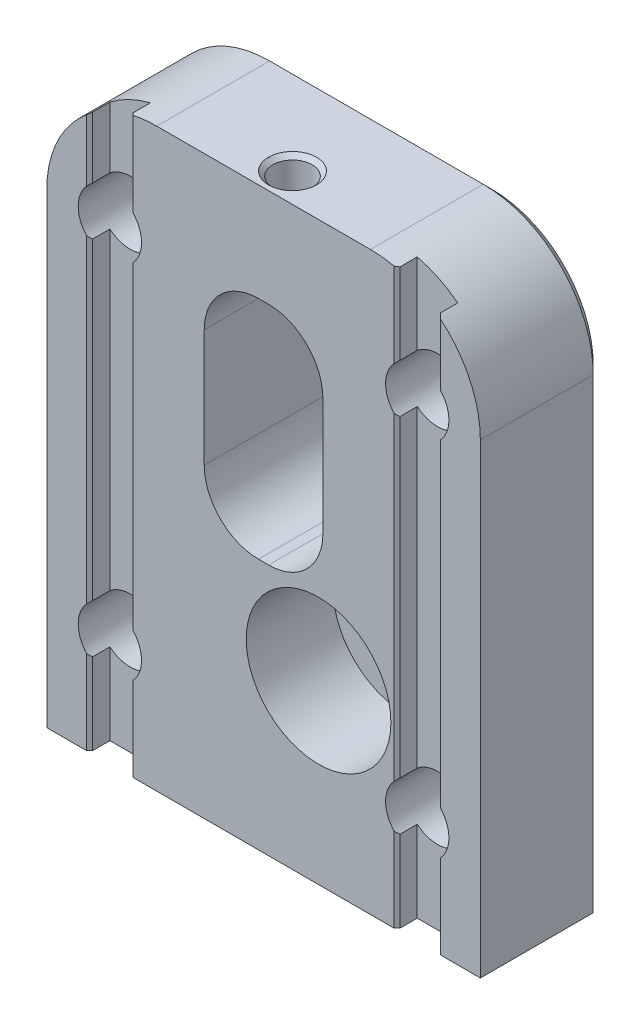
ISO-10303-21;
HEADER;
FILE_DESCRIPTION(('STEP AP214'),'2;1');
FILE_NAME('part.step','',(''),(''),'','','');
FILE_SCHEMA(('AUTOMOTIVE_DESIGN { 1 0 10303 214 1 1 1 1 }'));
ENDSEC;
DATA;
#1=APPLICATION_CONTEXT('core data for automotive mechanical design processes');
#2=APPLICATION_PROTOCOL_DEFINITION('international standard','automotive_design',2000,#1);
#3=PRODUCT_CONTEXT('',#1,'mechanical');
#4=PRODUCT('Part','Part','',(#3));
#5=PRODUCT_RELATED_PRODUCT_CATEGORY('part','',(#4));
#6=PRODUCT_DEFINITION_FORMATION('','',#4);
#7=PRODUCT_DEFINITION_CONTEXT('part definition',#1,'design');
#8=PRODUCT_DEFINITION('design','',#6,#7);
#9=PRODUCT_DEFINITION_SHAPE('','',#8);
#10=(LENGTH_UNIT() NAMED_UNIT(*) SI_UNIT(.MILLI.,.METRE.));
#11=(NAMED_UNIT(*) PLANE_ANGLE_UNIT() SI_UNIT($,.RADIAN.));
#12=(NAMED_UNIT(*) SI_UNIT($,.STERADIAN.) SOLID_ANGLE_UNIT());
#13=UNCERTAINTY_MEASURE_WITH_UNIT(LENGTH_MEASURE(1.E-05),#10,'distance_accuracy_value','');
#14=(GEOMETRIC_REPRESENTATION_CONTEXT(3) GLOBAL_UNCERTAINTY_ASSIGNED_CONTEXT((#13)) GLOBAL_UNIT_ASSIGNED_CONTEXT((#10,
#11,#12)) REPRESENTATION_CONTEXT('',''));
#15=CARTESIAN_POINT('',(0.,0.,0.));
#16=DIRECTION('',(0.,0.,1.));
#17=DIRECTION('',(1.,0.,0.));
#18=AXIS2_PLACEMENT_3D('',#15,#16,#17);
#19=CARTESIAN_POINT('',(-5.207,42.164,-127.951419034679));
#20=DIRECTION('',(0.,-1.,0.));
#21=DIRECTION('',(0.,0.,-1.));
#22=AXIS2_PLACEMENT_3D('',#19,#20,#21);
#23=PLANE('',#22);
#24=DIRECTION('',(0.,0.,1.));
#25=VECTOR('',#24,1.);
#26=CARTESIAN_POINT('',(0.4445,42.164,-11.684));
#27=LINE('',#26,#25);
#28=CARTESIAN_POINT('',(0.4445,42.164,-12.5549764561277));
#29=VERTEX_POINT('',#28);
#30=CARTESIAN_POINT('',(0.4445,42.164,-12.1891841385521));
#31=VERTEX_POINT('',#30);
#32=EDGE_CURVE('E651',#29,#31,#27,.T.);
#33=ORIENTED_EDGE('',*,*,#32,.T.);
#34=CARTESIAN_POINT('',(0.,42.164,-14.224));
#35=DIRECTION('',(0.,-1.,0.));
#36=DIRECTION('',(0.,0.,-1.));
#37=AXIS2_PLACEMENT_3D('',#34,#35,#36);
#38=CIRCLE('',#37,2.0828);
#39=CARTESIAN_POINT('',(-0.4445,42.164,-12.1891841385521));
#40=VERTEX_POINT('',#39);
#41=EDGE_CURVE('E617',#31,#40,#38,.T.);
#42=ORIENTED_EDGE('',*,*,#41,.T.);
#43=DIRECTION('',(0.,0.,1.));
#44=VECTOR('',#43,1.);
#45=CARTESIAN_POINT('',(-0.4445,42.164,-22.352));
#46=LINE('',#45,#44);
#47=CARTESIAN_POINT('',(-0.4445,42.164,-12.5549764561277));
#48=VERTEX_POINT('',#47);
#49=EDGE_CURVE('E648',#40,#48,#46,.F.);
#50=ORIENTED_EDGE('',*,*,#49,.T.);
#51=CARTESIAN_POINT('',(0.,42.164,-14.224));
#52=DIRECTION('',(0.,-1.,0.));
#53=DIRECTION('',(0.,0.,-1.));
#54=AXIS2_PLACEMENT_3D('',#51,#52,#53);
#55=CIRCLE('',#54,1.7272);
#56=EDGE_CURVE('E575',#29,#48,#55,.T.);
#57=ORIENTED_EDGE('',*,*,#56,.F.);
#58=EDGE_LOOP('',(#33,#42,#50,#57));
#59=FACE_BOUND('',#58,.T.);
#60=ADVANCED_FACE('F15',(#59),#23,.T.);
#61=CARTESIAN_POINT('',(-0.444500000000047,42.164,-15.8930235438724));
#62=VERTEX_POINT('',#61);
#63=CARTESIAN_POINT('',(-0.4445,42.164,-16.2588158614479));
#64=VERTEX_POINT('',#63);
#65=EDGE_CURVE('E657',#62,#64,#46,.F.);
#66=ORIENTED_EDGE('',*,*,#65,.T.);
#67=CARTESIAN_POINT('',(0.,42.164,-14.224));
#68=DIRECTION('',(0.,-1.,0.));
#69=DIRECTION('',(0.,0.,-1.));
#70=AXIS2_PLACEMENT_3D('',#67,#68,#69);
#71=CIRCLE('',#70,2.0828);
#72=CARTESIAN_POINT('',(0.4445,42.164,-16.2588158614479));
#73=VERTEX_POINT('',#72);
#74=EDGE_CURVE('E638',#64,#73,#71,.T.);
#75=ORIENTED_EDGE('',*,*,#74,.T.);
#76=CARTESIAN_POINT('',(0.4445,42.164,-15.8930235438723));
#77=VERTEX_POINT('',#76);
#78=EDGE_CURVE('E951',#73,#77,#27,.T.);
#79=ORIENTED_EDGE('',*,*,#78,.T.);
#80=EDGE_CURVE('E576',#62,#77,#55,.T.);
#81=ORIENTED_EDGE('',*,*,#80,.F.);
#82=EDGE_LOOP('',(#66,#75,#79,#81));
#83=FACE_BOUND('',#82,.T.);
#84=ADVANCED_FACE('F584',(#83),#23,.T.);
#85=CARTESIAN_POINT('',(0.4445,37.4015,-127.951419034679));
#86=DIRECTION('',(0.,0.,-1.));
#87=DIRECTION('',(-1.,0.,0.));
#88=AXIS2_PLACEMENT_3D('',#85,#86,#87);
#89=CYLINDRICAL_SURFACE('',#88,4.7625);
#90=CARTESIAN_POINT('',(0.4445,42.164,-12.1891841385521));
#91=CARTESIAN_POINT('',(0.500001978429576,42.164007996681,-12.2013003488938));
#92=CARTESIAN_POINT('',(0.554995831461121,42.1630299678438,-12.215700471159));
#93=CARTESIAN_POINT('',(0.6635480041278,42.1592675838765,-12.2489122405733));
#94=CARTESIAN_POINT('',(0.717106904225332,42.1564839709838,-12.2677220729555));
#95=CARTESIAN_POINT('',(0.822246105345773,42.1492875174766,-12.3095395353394));
#96=CARTESIAN_POINT('',(0.87383223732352,42.144879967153,-12.3325334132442));
#97=CARTESIAN_POINT('',(0.974848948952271,42.1346508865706,-12.3825587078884));
#98=CARTESIAN_POINT('',(1.02427936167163,42.1288292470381,-12.4095904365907));
#99=CARTESIAN_POINT('',(1.16873097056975,42.1096093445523,-12.4963697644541));
#100=CARTESIAN_POINT('',(1.26013486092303,42.0944391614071,-12.5618904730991));
#101=CARTESIAN_POINT('',(1.43099511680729,42.0615257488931,-12.706480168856));
#102=CARTESIAN_POINT('',(1.51044119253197,42.0437803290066,-12.7855607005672));
#103=CARTESIAN_POINT('',(1.65886510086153,42.0072377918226,-12.9591551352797));
#104=CARTESIAN_POINT('',(1.72722280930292,41.9884289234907,-13.0541977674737));
#105=CARTESIAN_POINT('',(1.84721226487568,41.9531740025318,-13.254728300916));
#106=CARTESIAN_POINT('',(1.89885246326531,41.9367267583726,-13.3602108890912));
#107=CARTESIAN_POINT('',(1.96442506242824,41.9150150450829,-13.5288965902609));
#108=CARTESIAN_POINT('',(1.98481491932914,41.9080709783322,-13.5894487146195));
#109=CARTESIAN_POINT('',(2.01998755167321,41.895895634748,-13.7123486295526));
#110=CARTESIAN_POINT('',(2.03477026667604,41.8906643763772,-13.7746964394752));
#111=CARTESIAN_POINT('',(2.05859181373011,41.8821566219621,-13.9008980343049));
#112=CARTESIAN_POINT('',(2.0676048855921,41.8788888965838,-13.9647572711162));
#113=CARTESIAN_POINT('',(2.07968804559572,41.8744827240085,-14.0931341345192));
#114=CARTESIAN_POINT('',(2.08275563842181,41.8733451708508,-14.1576520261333));
#115=CARTESIAN_POINT('',(2.0827992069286,41.8733432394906,-14.2221824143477));
#116=B_SPLINE_CURVE_WITH_KNOTS('',3,(#90,#91,#92,#93,#94,#95,#96,#97,#98,#99,#100,#101,#102,
#103,#104,#105,#106,#107,#108,#109,#110,#111,#112,#113,#114,#115),.UNSPECIFIED.,.F.,.F.,(4,2,2,
2,2,2,2,2,2,2,2,2,4),(0.,0.170356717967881,0.340643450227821,0.510380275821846,
0.680130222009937,1.01891889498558,1.35799745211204,1.71210626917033,2.06603579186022,
2.25859444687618,2.45115517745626,2.64456976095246,2.83806550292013),.UNSPECIFIED.);
#117=CARTESIAN_POINT('',(2.0827992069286,41.8733432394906,-14.2221824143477));
#118=VERTEX_POINT('',#117);
#119=EDGE_CURVE('E616',#31,#118,#116,.T.);
#120=ORIENTED_EDGE('',*,*,#119,.F.);
#121=ORIENTED_EDGE('',*,*,#32,.F.);
#122=CARTESIAN_POINT('',(0.4445,42.164,-12.5549764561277));
#123=CARTESIAN_POINT('',(0.490591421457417,42.1640033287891,-12.5672505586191));
#124=CARTESIAN_POINT('',(0.536148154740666,42.1633302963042,-12.5814303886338));
#125=CARTESIAN_POINT('',(0.625890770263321,42.1607555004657,-12.6134872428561));
#126=CARTESIAN_POINT('',(0.670077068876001,42.1588541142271,-12.6313631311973));
#127=CARTESIAN_POINT('',(0.799889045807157,42.1515085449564,-12.6902490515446));
#128=CARTESIAN_POINT('',(0.883070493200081,42.1444213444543,-12.7365984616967));
#129=CARTESIAN_POINT('',(1.04039381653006,42.1272379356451,-12.8420524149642));
#130=CARTESIAN_POINT('',(1.11454146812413,42.1171436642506,-12.9011487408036));
#131=CARTESIAN_POINT('',(1.25213026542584,42.0955381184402,-13.0305555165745));
#132=CARTESIAN_POINT('',(1.31556611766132,42.0840261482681,-13.1008714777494));
#133=CARTESIAN_POINT('',(1.43178467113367,42.0609308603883,-13.2531012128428));
#134=CARTESIAN_POINT('',(1.48420876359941,42.0493550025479,-13.3352902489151));
#135=CARTESIAN_POINT('',(1.57458814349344,42.0282127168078,-13.5075179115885));
#136=CARTESIAN_POINT('',(1.61254421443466,42.0186461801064,-13.5975561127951));
#137=CARTESIAN_POINT('',(1.67273544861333,42.0030017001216,-13.7828217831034));
#138=CARTESIAN_POINT('',(1.69500597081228,41.9969159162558,-13.8780370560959));
#139=CARTESIAN_POINT('',(1.72317164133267,41.9891601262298,-14.0710228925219));
#140=CARTESIAN_POINT('',(1.72907163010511,41.9874888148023,-14.1687926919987));
#141=CARTESIAN_POINT('',(1.7243717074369,41.9888015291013,-14.3605658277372));
#142=CARTESIAN_POINT('',(1.71432510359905,41.9916294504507,-14.4545843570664));
#143=CARTESIAN_POINT('',(1.67911089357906,42.0012250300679,-14.6395359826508));
#144=CARTESIAN_POINT('',(1.653941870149,42.0079930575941,-14.7304687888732));
#145=CARTESIAN_POINT('',(1.58923561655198,42.0244962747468,-14.9069340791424));
#146=CARTESIAN_POINT('',(1.54967504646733,42.0342362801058,-14.9924575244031));
#147=CARTESIAN_POINT('',(1.45730652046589,42.0553012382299,-15.1558192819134));
#148=CARTESIAN_POINT('',(1.40449530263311,42.066626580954,-15.2336556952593));
#149=CARTESIAN_POINT('',(1.28491354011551,42.0896699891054,-15.3822857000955));
#150=CARTESIAN_POINT('',(1.21772240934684,42.1013880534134,-15.4527414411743));
#151=CARTESIAN_POINT('',(1.07233473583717,42.1230058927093,-15.5814754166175));
#152=CARTESIAN_POINT('',(0.994143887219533,42.132906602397,-15.6397599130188));
#153=CARTESIAN_POINT('',(0.839365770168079,42.148154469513,-15.7359145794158));
#154=CARTESIAN_POINT('',(0.763851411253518,42.1539219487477,-15.7754419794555));
#155=CARTESIAN_POINT('',(0.646727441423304,42.159866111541,-15.8261178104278));
#156=CARTESIAN_POINT('',(0.607008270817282,42.1613964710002,-15.8415834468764));
#157=CARTESIAN_POINT('',(0.526500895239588,42.1634647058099,-15.8695494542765));
#158=CARTESIAN_POINT('',(0.485712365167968,42.1640022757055,-15.8820489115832));
#159=CARTESIAN_POINT('',(0.4445,42.164,-15.8930235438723));
#160=B_SPLINE_CURVE_WITH_KNOTS('',3,(#122,#123,#124,#125,#126,#127,#128,#129,#130,#131,#132,
#133,#134,#135,#136,#137,#138,#139,#140,#141,#142,#143,#144,#145,#146,#147,#148,#149,#150,#151,
#152,#153,#154,#155,#156,#157,#158,#159),.UNSPECIFIED.,.F.,.F.,(4,2,2,2,2,2,2,2,2,2,2,2,2,2,2,2,
2,2,4),(0.,0.142997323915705,0.285950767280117,0.570930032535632,0.855726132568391,
1.14066256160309,1.43378886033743,1.72689928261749,2.01934683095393,2.31170789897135,
2.59414446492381,2.87660750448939,3.15953069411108,3.44252359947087,3.73533050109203,
4.02798638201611,4.28322860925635,4.41106952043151,4.53894975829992),.UNSPECIFIED.);
#161=EDGE_CURVE('E566',#29,#77,#160,.T.);
#162=ORIENTED_EDGE('',*,*,#161,.T.);
#163=ORIENTED_EDGE('',*,*,#78,.F.);
#164=CARTESIAN_POINT('',(2.0828,41.8733429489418,-14.224));
#165=CARTESIAN_POINT('',(2.08280766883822,41.8733316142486,-14.2808723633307));
#166=CARTESIAN_POINT('',(2.08047077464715,41.8741960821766,-14.3377390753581));
#167=CARTESIAN_POINT('',(2.0711678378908,41.8775923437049,-14.4510250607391));
#168=CARTESIAN_POINT('',(2.06420325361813,41.8801236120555,-14.5074444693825));
#169=CARTESIAN_POINT('',(2.0457340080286,41.8867588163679,-14.6192595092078));
#170=CARTESIAN_POINT('',(2.03424373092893,41.8908577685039,-14.6746578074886));
#171=CARTESIAN_POINT('',(2.00684121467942,41.9004671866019,-14.7842110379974));
#172=CARTESIAN_POINT('',(1.99092876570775,41.905977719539,-14.8383659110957));
#173=CARTESIAN_POINT('',(1.93677943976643,41.9243284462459,-14.9983256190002));
#174=CARTESIAN_POINT('',(1.89209828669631,41.9390003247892,-15.1018186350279));
#175=CARTESIAN_POINT('',(1.78690536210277,41.9712223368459,-15.2999355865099));
#176=CARTESIAN_POINT('',(1.72638069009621,41.9887748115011,-15.3945522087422));
#177=CARTESIAN_POINT('',(1.58834068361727,42.0251702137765,-15.5763161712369));
#178=CARTESIAN_POINT('',(1.51024981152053,42.0440367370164,-15.6630222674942));
#179=CARTESIAN_POINT('',(1.34043587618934,42.0797687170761,-15.8223803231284));
#180=CARTESIAN_POINT('',(1.24871956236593,42.0966351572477,-15.8950392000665));
#181=CARTESIAN_POINT('',(1.09816709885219,42.1192365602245,-15.9949259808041));
#182=CARTESIAN_POINT('',(1.04325032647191,42.1265535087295,-16.0278266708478));
#183=CARTESIAN_POINT('',(0.930449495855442,42.1394825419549,-16.0885152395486));
#184=CARTESIAN_POINT('',(0.87256550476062,42.1450946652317,-16.116303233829));
#185=CARTESIAN_POINT('',(0.754073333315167,42.1543001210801,-16.1665721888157));
#186=CARTESIAN_POINT('',(0.693454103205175,42.1578842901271,-16.189028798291));
#187=CARTESIAN_POINT('',(0.570278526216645,42.1627414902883,-16.2282536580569));
#188=CARTESIAN_POINT('',(0.507721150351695,42.1640132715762,-16.245018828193));
#189=CARTESIAN_POINT('',(0.4445,42.164,-16.2588158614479));
#190=B_SPLINE_CURVE_WITH_KNOTS('',3,(#164,#165,#166,#167,#168,#169,#170,#171,#172,#173,#174,
#175,#176,#177,#178,#179,#180,#181,#182,#183,#184,#185,#186,#187,#188,#189),.UNSPECIFIED.,.F.,
.F.,(4,2,2,2,2,2,2,2,2,2,2,2,4),(0.,0.170553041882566,0.341052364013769,0.511014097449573,
0.680983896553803,1.0203423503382,1.35997798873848,1.71299698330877,2.06584168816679,
2.25889638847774,2.45194672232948,2.64586254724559,2.83988315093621),.UNSPECIFIED.);
#191=CARTESIAN_POINT('',(2.0828,41.8733429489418,-14.224));
#192=VERTEX_POINT('',#191);
#193=EDGE_CURVE('E609',#192,#73,#190,.T.);
#194=ORIENTED_EDGE('',*,*,#193,.F.);
#195=CARTESIAN_POINT('',(0.4445,37.4015,-14.224));
#196=DIRECTION('',(0.,0.,1.));
#197=DIRECTION('',(1.,0.,0.));
#198=AXIS2_PLACEMENT_3D('',#195,#196,#197);
#199=CIRCLE('',#198,4.7625);
#200=CARTESIAN_POINT('',(2.083054,41.8732498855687,-14.224));
#201=VERTEX_POINT('',#200);
#202=EDGE_CURVE('E1019',#201,#192,#199,.T.);
#203=ORIENTED_EDGE('',*,*,#202,.F.);
#204=CARTESIAN_POINT('',(2.083054,41.8732498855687,-14.224));
#205=CARTESIAN_POINT('',(2.0830616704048,41.8732385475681,-14.2808787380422));
#206=CARTESIAN_POINT('',(2.08072453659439,41.8741032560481,-14.3377518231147));
#207=CARTESIAN_POINT('',(2.07142065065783,41.8775004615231,-14.451050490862));
#208=CARTESIAN_POINT('',(2.06445535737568,41.8800324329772,-14.5074762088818));
#209=CARTESIAN_POINT('',(2.04598424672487,41.8866694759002,-14.6193036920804));
#210=CARTESIAN_POINT('',(2.03449281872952,41.8907695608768,-14.6747081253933));
#211=CARTESIAN_POINT('',(2.00708757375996,41.900381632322,-14.7842734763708));
#212=CARTESIAN_POINT('',(1.9911735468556,41.9058936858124,-14.8384343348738));
#213=CARTESIAN_POINT('',(1.93701889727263,41.9242494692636,-14.9984116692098));
#214=CARTESIAN_POINT('',(1.89233339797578,41.9389253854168,-15.1019160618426));
#215=CARTESIAN_POINT('',(1.78713032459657,41.9711563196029,-15.3000549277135));
#216=CARTESIAN_POINT('',(1.72659984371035,41.9887136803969,-15.3946820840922));
#217=CARTESIAN_POINT('',(1.58854576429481,42.0251196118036,-15.5764676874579));
#218=CARTESIAN_POINT('',(1.51044638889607,42.0439917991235,-15.6631847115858));
#219=CARTESIAN_POINT('',(1.34061372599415,42.0797348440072,-15.8225631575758));
#220=CARTESIAN_POINT('',(1.24888719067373,42.096606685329,-15.8952314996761));
#221=CARTESIAN_POINT('',(1.09831254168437,42.1192165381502,-15.9951350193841));
#222=CARTESIAN_POINT('',(1.0433840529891,42.1265367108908,-16.0280431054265));
#223=CARTESIAN_POINT('',(0.930558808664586,42.1394714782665,-16.0887449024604));
#224=CARTESIAN_POINT('',(0.872662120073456,42.1450861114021,-16.1165387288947));
#225=CARTESIAN_POINT('',(0.754143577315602,42.1542957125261,-16.1668177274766));
#226=CARTESIAN_POINT('',(0.693510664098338,42.1578815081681,-16.1892785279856));
#227=CARTESIAN_POINT('',(0.570307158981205,42.1627409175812,-16.2285099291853));
#228=CARTESIAN_POINT('',(0.507735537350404,42.1640132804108,-16.2452774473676));
#229=CARTESIAN_POINT('',(0.4445,42.164,-16.2590758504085));
#230=B_SPLINE_CURVE_WITH_KNOTS('',3,(#204,#205,#206,#207,#208,#209,#210,#211,#212,#213,#214,
#215,#216,#217,#218,#219,#220,#221,#222,#223,#224,#225,#226,#227,#228,#229),.UNSPECIFIED.,.F.,
.F.,(4,2,2,2,2,2,2,2,2,2,2,2,4),(0.,0.170572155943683,0.341090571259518,0.51107119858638,
0.681059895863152,1.02045594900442,1.36012932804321,1.71319176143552,2.06607983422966,
2.25917680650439,2.45226941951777,2.64622816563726,2.84029175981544),.UNSPECIFIED.);
#231=CARTESIAN_POINT('',(0.4445,42.164,-16.2590758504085));
#232=VERTEX_POINT('',#231);
#233=EDGE_CURVE('E594',#201,#232,#230,.T.);
#234=ORIENTED_EDGE('',*,*,#233,.T.);
#235=CARTESIAN_POINT('',(0.4445,42.164,-22.352));
#236=VERTEX_POINT('',#235);
#237=EDGE_CURVE('E952',#236,#232,#27,.T.);
#238=ORIENTED_EDGE('',*,*,#237,.F.);
#239=CARTESIAN_POINT('',(0.4445,37.4015,-22.352));
#240=DIRECTION('',(0.,0.,-1.));
#241=DIRECTION('',(-1.,0.,0.));
#242=AXIS2_PLACEMENT_3D('',#239,#240,#241);
#243=CIRCLE('',#242,4.7625);
#244=CARTESIAN_POINT('',(5.207,37.4015,-22.352));
#245=VERTEX_POINT('',#244);
#246=EDGE_CURVE('E968',#245,#236,#243,.F.);
#247=ORIENTED_EDGE('',*,*,#246,.F.);
#248=DIRECTION('',(0.,0.,1.));
#249=VECTOR('',#248,1.);
#250=CARTESIAN_POINT('',(5.207,37.4015,-22.352));
#251=LINE('',#250,#249);
#252=CARTESIAN_POINT('',(5.207,37.4015,-11.684));
#253=VERTEX_POINT('',#252);
#254=EDGE_CURVE('E671',#253,#245,#251,.F.);
#255=ORIENTED_EDGE('',*,*,#254,.F.);
#256=CARTESIAN_POINT('',(0.4445,37.4015,-11.684));
#257=DIRECTION('',(0.,0.,1.));
#258=DIRECTION('',(1.,0.,0.));
#259=AXIS2_PLACEMENT_3D('',#256,#257,#258);
#260=CIRCLE('',#259,4.7625);
#261=CARTESIAN_POINT('',(0.4445,42.164,-11.684));
#262=VERTEX_POINT('',#261);
#263=EDGE_CURVE('E966',#262,#253,#260,.F.);
#264=ORIENTED_EDGE('',*,*,#263,.F.);
#265=CARTESIAN_POINT('',(0.4445,42.164,-12.1889241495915));
#266=VERTEX_POINT('',#265);
#267=EDGE_CURVE('E661',#266,#262,#27,.T.);
#268=ORIENTED_EDGE('',*,*,#267,.F.);
#269=CARTESIAN_POINT('',(0.4445,42.164,-12.1889241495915));
#270=CARTESIAN_POINT('',(0.500008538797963,42.1640079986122,-12.2010402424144));
#271=CARTESIAN_POINT('',(0.555008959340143,42.1630297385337,-12.215440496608));
#272=CARTESIAN_POINT('',(0.663574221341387,42.1592664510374,-12.2486530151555));
#273=CARTESIAN_POINT('',(0.717139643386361,42.1564821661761,-12.2674634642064));
#274=CARTESIAN_POINT('',(0.822291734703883,42.149283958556,-12.3092826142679));
#275=CARTESIAN_POINT('',(0.873884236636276,42.1448753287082,-12.3322775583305));
#276=CARTESIAN_POINT('',(0.974913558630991,42.1346437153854,-12.3823054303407));
#277=CARTESIAN_POINT('',(1.02435021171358,42.1288206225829,-12.4093386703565));
#278=CARTESIAN_POINT('',(1.16882024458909,42.109595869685,-12.4961231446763));
#279=CARTESIAN_POINT('',(1.26023608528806,42.0944217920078,-12.5616481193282));
#280=CARTESIAN_POINT('',(1.4311194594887,42.061499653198,-12.7062479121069));
#281=CARTESIAN_POINT('',(1.51057669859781,42.043749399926,-12.7853342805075));
#282=CARTESIAN_POINT('',(1.65902334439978,42.0071962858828,-12.9589431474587));
#283=CARTESIAN_POINT('',(1.72739242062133,41.9883816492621,-13.0539945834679));
#284=CARTESIAN_POINT('',(1.84740309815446,41.9531153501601,-13.2545445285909));
#285=CARTESIAN_POINT('',(1.89905315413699,41.9366624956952,-13.3600377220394));
#286=CARTESIAN_POINT('',(1.96464183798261,41.9149420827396,-13.5287468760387));
#287=CARTESIAN_POINT('',(1.98503802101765,41.9079947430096,-13.589311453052));
#288=CARTESIAN_POINT('',(2.02022162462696,41.8958136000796,-13.7122370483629));
#289=CARTESIAN_POINT('',(2.03500898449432,41.8905798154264,-13.7745980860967));
#290=CARTESIAN_POINT('',(2.05883807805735,41.8820679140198,-13.9008268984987));
#291=CARTESIAN_POINT('',(2.06785402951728,41.878798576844,-13.9647001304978));
#292=CARTESIAN_POINT('',(2.07994105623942,41.8743902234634,-14.093105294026));
#293=CARTESIAN_POINT('',(2.08300963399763,41.8732521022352,-14.1576374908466));
#294=CARTESIAN_POINT('',(2.08305320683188,41.8732501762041,-14.2221821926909));
#295=B_SPLINE_CURVE_WITH_KNOTS('',3,(#269,#270,#271,#272,#273,#274,#275,#276,#277,#278,#279,
#280,#281,#282,#283,#284,#285,#286,#287,#288,#289,#290,#291,#292,#293,#294),.UNSPECIFIED.,.F.,
.F.,(4,2,2,2,2,2,2,2,2,2,2,2,4),(0.,0.17037586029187,0.340681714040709,0.510437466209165,
0.680206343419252,1.01903268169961,1.3581490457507,1.71230126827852,2.06627411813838,
2.25887493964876,2.45147784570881,2.6449352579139,2.83847389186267),.UNSPECIFIED.);
#296=CARTESIAN_POINT('',(2.08305320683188,41.8732501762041,-14.2221821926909));
#297=VERTEX_POINT('',#296);
#298=EDGE_CURVE('E602',#266,#297,#295,.T.);
#299=ORIENTED_EDGE('',*,*,#298,.T.);
#300=CARTESIAN_POINT('',(0.4445,37.4015,-14.2236121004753));
#301=DIRECTION('',(-0.000872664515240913,0.,0.99999961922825));
#302=DIRECTION('',(-0.99999961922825,0.,-0.000872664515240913));
#303=AXIS2_PLACEMENT_3D('',#300,#301,#302);
#304=ELLIPSE('',#303,4.76250181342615,4.7625);
#305=EDGE_CURVE('E424',#118,#297,#304,.F.);
#306=ORIENTED_EDGE('',*,*,#305,.F.);
#307=EDGE_LOOP('',(#120,#121,#162,#163,#194,#203,#234,#238,#247,#255,#264,#268,#299,#306));
#308=FACE_BOUND('',#307,.T.);
#309=ADVANCED_FACE('F579',(#308),#89,.F.);
#310=CARTESIAN_POINT('',(-0.4445,37.4015,-127.951419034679));
#311=DIRECTION('',(0.,0.,-1.));
#312=DIRECTION('',(-1.,0.,0.));
#313=AXIS2_PLACEMENT_3D('',#310,#311,#312);
#314=CYLINDRICAL_SURFACE('',#313,4.7625);
#315=CARTESIAN_POINT('',(-0.4445,42.164,-16.2588158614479));
#316=CARTESIAN_POINT('',(-0.500004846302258,42.164007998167,-16.2466990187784));
#317=CARTESIAN_POINT('',(-0.555001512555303,42.1630298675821,-16.2322980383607));
#318=CARTESIAN_POINT('',(-0.663559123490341,42.1592671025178,-16.1990841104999));
#319=CARTESIAN_POINT('',(-0.717120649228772,42.156483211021,-16.1802729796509));
#320=CARTESIAN_POINT('',(-0.822259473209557,42.1492864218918,-16.1384546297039));
#321=CARTESIAN_POINT('',(-0.87384278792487,42.1448789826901,-16.1154615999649));
#322=CARTESIAN_POINT('',(-0.974854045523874,42.1346502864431,-16.065438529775));
#323=CARTESIAN_POINT('',(-1.02428182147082,42.1288289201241,-16.0384081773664));
#324=CARTESIAN_POINT('',(-1.16873145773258,42.1096092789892,-15.9516297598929));
#325=CARTESIAN_POINT('',(-1.26013599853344,42.0944389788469,-15.8861077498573));
#326=CARTESIAN_POINT('',(-1.43099551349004,42.0615256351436,-15.7415203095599));
#327=CARTESIAN_POINT('',(-1.51044030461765,42.0437804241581,-15.6624434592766));
#328=CARTESIAN_POINT('',(-1.65884894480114,42.0072418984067,-15.4888605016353));
#329=CARTESIAN_POINT('',(-1.72719622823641,41.9884368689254,-15.3938278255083));
#330=CARTESIAN_POINT('',(-1.84718350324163,41.9531823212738,-15.1933385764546));
#331=CARTESIAN_POINT('',(-1.89882427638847,41.9367326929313,-15.0878824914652));
#332=CARTESIAN_POINT('',(-1.98410652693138,41.9085017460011,-14.8684517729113));
#333=CARTESIAN_POINT('',(-2.01762253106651,41.8967531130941,-14.7544238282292));
#334=CARTESIAN_POINT('',(-2.06479676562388,41.8799695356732,-14.5218732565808));
#335=CARTESIAN_POINT('',(-2.0784651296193,41.8749311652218,-14.4033529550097));
#336=CARTESIAN_POINT('',(-2.08518389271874,41.8724693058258,-14.172292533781));
#337=CARTESIAN_POINT('',(-2.07934188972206,41.8746367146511,-14.0597876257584));
#338=CARTESIAN_POINT('',(-2.04969285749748,41.8853605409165,-13.837489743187));
#339=CARTESIAN_POINT('',(-2.02588487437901,41.8939172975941,-13.7276969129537));
#340=CARTESIAN_POINT('',(-1.96155590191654,41.9160405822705,-13.5150890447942));
#341=CARTESIAN_POINT('',(-1.92123067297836,41.9295482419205,-13.4122081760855));
#342=CARTESIAN_POINT('',(-1.82510186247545,41.9597753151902,-13.214469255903));
#343=CARTESIAN_POINT('',(-1.76929484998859,41.9764954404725,-13.1196129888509));
#344=CARTESIAN_POINT('',(-1.64014414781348,42.0119835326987,-12.9350661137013));
#345=CARTESIAN_POINT('',(-1.56600917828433,42.0308134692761,-12.845940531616));
#346=CARTESIAN_POINT('',(-1.40377874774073,42.0671285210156,-12.6810009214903));
#347=CARTESIAN_POINT('',(-1.31567442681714,42.0846127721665,-12.6051954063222));
#348=CARTESIAN_POINT('',(-1.12550846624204,42.1160655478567,-12.4674740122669));
#349=CARTESIAN_POINT('',(-1.02317692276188,42.1299459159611,-12.4059098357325));
#350=CARTESIAN_POINT('',(-0.809071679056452,42.1512346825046,-12.3010891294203));
#351=CARTESIAN_POINT('',(-0.697323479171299,42.1586599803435,-12.2577849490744));
#352=CARTESIAN_POINT('',(-0.559936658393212,42.162656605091,-12.2177351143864));
#353=CARTESIAN_POINT('',(-0.536976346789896,42.1631583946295,-12.2114688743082));
#354=CARTESIAN_POINT('',(-0.490875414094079,42.1638294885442,-12.1997323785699));
#355=CARTESIAN_POINT('',(-0.46773502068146,42.1639991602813,-12.1942612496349));
#356=CARTESIAN_POINT('',(-0.4445,42.164,-12.1891841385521));
#357=B_SPLINE_CURVE_WITH_KNOTS('',3,(#315,#316,#317,#318,#319,#320,#321,#322,#323,#324,#325,
#326,#327,#328,#329,#330,#331,#332,#333,#334,#335,#336,#337,#338,#339,#340,#341,#342,#343,#344,
#345,#346,#347,#348,#349,#350,#351,#352,#353,#354,#355,#356),.UNSPECIFIED.,.F.,.F.,(4,2,2,2,2,2,
2,2,2,2,2,2,2,2,2,2,2,2,2,2,4),(0.,0.170365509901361,0.340660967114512,0.51038903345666,
0.680130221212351,1.0189204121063,1.3579974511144,1.71202489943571,2.06603578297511,
2.42246700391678,2.77871617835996,3.11509273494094,3.45148715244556,3.78400500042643,
4.11659659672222,4.46735196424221,4.81833069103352,5.17722284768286,5.53517256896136,
5.60658063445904,5.67790966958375),.UNSPECIFIED.);
#358=EDGE_CURVE('E633',#64,#40,#357,.T.);
#359=ORIENTED_EDGE('',*,*,#358,.F.);
#360=ORIENTED_EDGE('',*,*,#65,.F.);
#361=CARTESIAN_POINT('',(0.,42.143211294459,-15.9512));
#362=CARTESIAN_POINT('',(-0.0922013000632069,42.1518580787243,-15.9512043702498));
#363=CARTESIAN_POINT('',(-0.184630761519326,42.1577838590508,-15.9437962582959));
#364=CARTESIAN_POINT('',(-0.367273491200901,42.1642492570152,-15.9142302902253));
#365=CARTESIAN_POINT('',(-0.457487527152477,42.1647907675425,-15.8920776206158));
#366=CARTESIAN_POINT('',(-0.633014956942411,42.1610775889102,-15.8336782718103));
#367=CARTESIAN_POINT('',(-0.718332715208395,42.1568272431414,-15.7974443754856));
#368=CARTESIAN_POINT('',(-0.881885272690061,42.1445828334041,-15.711957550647));
#369=CARTESIAN_POINT('',(-0.960118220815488,42.136587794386,-15.6627012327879));
#370=CARTESIAN_POINT('',(-1.109158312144,42.118003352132,-15.5513388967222));
#371=CARTESIAN_POINT('',(-1.1797681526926,42.1073615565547,-15.4889779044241));
#372=CARTESIAN_POINT('',(-1.30988120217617,42.0851829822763,-15.3537090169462));
#373=CARTESIAN_POINT('',(-1.36938201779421,42.0736460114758,-15.2807988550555));
#374=CARTESIAN_POINT('',(-1.47788156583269,42.0508792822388,-15.1232129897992));
#375=CARTESIAN_POINT('',(-1.52638563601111,42.0396786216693,-15.0381915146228));
#376=CARTESIAN_POINT('',(-1.60843510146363,42.0197739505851,-14.8609384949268));
#377=CARTESIAN_POINT('',(-1.6419822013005,42.0110696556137,-14.7687077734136));
#378=CARTESIAN_POINT('',(-1.69276069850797,41.997578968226,-14.5806080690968));
#379=CARTESIAN_POINT('',(-1.71015867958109,41.9927526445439,-14.4847870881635));
#380=CARTESIAN_POINT('',(-1.72860912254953,41.9876276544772,-14.2914740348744));
#381=CARTESIAN_POINT('',(-1.72966529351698,41.9873279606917,-14.1939823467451));
#382=CARTESIAN_POINT('',(-1.7156373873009,41.9912342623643,-14.0034613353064));
#383=CARTESIAN_POINT('',(-1.70107602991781,41.9952943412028,-13.9103898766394));
#384=CARTESIAN_POINT('',(-1.65712495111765,42.0070899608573,-13.7280636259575));
#385=CARTESIAN_POINT('',(-1.62773376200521,42.0148258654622,-13.638809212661));
#386=CARTESIAN_POINT('',(-1.55468840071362,42.0329477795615,-13.4656621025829));
#387=CARTESIAN_POINT('',(-1.51090483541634,42.0433576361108,-13.3818266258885));
#388=CARTESIAN_POINT('',(-1.41035172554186,42.0653158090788,-13.2224978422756));
#389=CARTESIAN_POINT('',(-1.35357924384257,42.0768643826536,-13.1470064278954));
#390=CARTESIAN_POINT('',(-1.22634810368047,42.0998431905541,-13.0038509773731));
#391=CARTESIAN_POINT('',(-1.15549363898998,42.1112564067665,-12.9365352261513));
#392=CARTESIAN_POINT('',(-1.00324090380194,42.1317329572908,-12.8146621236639));
#393=CARTESIAN_POINT('',(-0.921843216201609,42.140796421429,-12.7601040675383));
#394=CARTESIAN_POINT('',(-0.751369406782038,42.1548658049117,-12.6657709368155));
#395=CARTESIAN_POINT('',(-0.662357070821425,42.1599023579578,-12.6258855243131));
#396=CARTESIAN_POINT('',(-0.478770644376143,42.1647601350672,-12.5616379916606));
#397=CARTESIAN_POINT('',(-0.384198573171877,42.1645832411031,-12.5372702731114));
#398=CARTESIAN_POINT('',(-0.196747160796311,42.1584348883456,-12.5055278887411));
#399=CARTESIAN_POINT('',(-0.103977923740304,42.1527200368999,-12.4974493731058));
#400=CARTESIAN_POINT('',(0.0811470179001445,42.1358150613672,-12.4962260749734));
#401=CARTESIAN_POINT('',(0.173502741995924,42.1246251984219,-12.5030805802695));
#402=CARTESIAN_POINT('',(0.354326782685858,42.0974097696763,-12.5310834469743));
#403=CARTESIAN_POINT('',(0.442823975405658,42.0814318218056,-12.5520934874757));
#404=CARTESIAN_POINT('',(0.614722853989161,42.0455469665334,-12.6073697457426));
#405=CARTESIAN_POINT('',(0.69812339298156,42.0256391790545,-12.6416389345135));
#406=CARTESIAN_POINT('',(0.862326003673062,41.9820249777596,-12.724494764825));
#407=CARTESIAN_POINT('',(0.94275315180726,41.9581727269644,-12.7737467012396));
#408=CARTESIAN_POINT('',(1.09434595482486,41.9092395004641,-12.8844313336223));
#409=CARTESIAN_POINT('',(1.16550705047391,41.8841579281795,-12.9458699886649));
#410=CARTESIAN_POINT('',(1.30119559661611,41.8331510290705,-13.0838059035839));
#411=CARTESIAN_POINT('',(1.36503019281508,41.807270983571,-13.1610044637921));
#412=CARTESIAN_POINT('',(1.47880161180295,41.758810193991,-13.3260008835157));
#413=CARTESIAN_POINT('',(1.52873903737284,41.7362293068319,-13.4137982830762));
#414=CARTESIAN_POINT('',(1.61205229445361,41.6973214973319,-13.5960384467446));
#415=CARTESIAN_POINT('',(1.64574167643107,41.6808776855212,-13.6903115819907));
#416=CARTESIAN_POINT('',(1.69640016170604,41.6557653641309,-13.8842083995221));
#417=CARTESIAN_POINT('',(1.71338676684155,41.6470887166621,-13.983826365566));
#418=CARTESIAN_POINT('',(1.72887337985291,41.639177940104,-14.174644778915));
#419=CARTESIAN_POINT('',(1.72907352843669,41.6390754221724,-14.2656742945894));
#420=CARTESIAN_POINT('',(1.7152221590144,41.6461514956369,-14.4463457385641));
#421=CARTESIAN_POINT('',(1.70117170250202,41.6533295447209,-14.5359877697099));
#422=CARTESIAN_POINT('',(1.66033475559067,41.6736848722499,-14.7077294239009));
#423=CARTESIAN_POINT('',(1.63407922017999,41.6866111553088,-14.7899872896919));
#424=CARTESIAN_POINT('',(1.57003529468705,41.7170887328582,-14.9489540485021));
#425=CARTESIAN_POINT('',(1.53224364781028,41.7346413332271,-15.0256613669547));
#426=CARTESIAN_POINT('',(1.44289817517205,41.7743362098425,-15.1777455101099));
#427=CARTESIAN_POINT('',(1.3905090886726,41.7967277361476,-15.2525656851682));
#428=CARTESIAN_POINT('',(1.27494371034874,41.8432112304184,-15.392760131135));
#429=CARTESIAN_POINT('',(1.21176261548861,41.8673039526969,-15.4581301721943));
#430=CARTESIAN_POINT('',(1.06975500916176,41.9175379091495,-15.5836359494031));
#431=CARTESIAN_POINT('',(0.990030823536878,41.943667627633,-15.6427656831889));
#432=CARTESIAN_POINT('',(0.821075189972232,41.9936113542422,-15.7467941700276));
#433=CARTESIAN_POINT('',(0.731840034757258,42.0174244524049,-15.7916873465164));
#434=CARTESIAN_POINT('',(0.538562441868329,42.0625718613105,-15.868635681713));
#435=CARTESIAN_POINT('',(0.433906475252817,42.0835548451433,-15.8993745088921));
#436=CARTESIAN_POINT('',(0.219605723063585,42.1187154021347,-15.9406457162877));
#437=CARTESIAN_POINT('',(0.109965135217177,42.1328985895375,-15.9511947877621));
#438=CARTESIAN_POINT('',(0.,42.143211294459,-15.9512));
#439=B_SPLINE_CURVE_WITH_KNOTS('',3,(#361,#362,#363,#364,#365,#366,#367,#368,#369,#370,#371,
#372,#373,#374,#375,#376,#377,#378,#379,#380,#381,#382,#383,#384,#385,#386,#387,#388,#389,#390,
#391,#392,#393,#394,#395,#396,#397,#398,#399,#400,#401,#402,#403,#404,#405,#406,#407,#408,#409,
#410,#411,#412,#413,#414,#415,#416,#417,#418,#419,#420,#421,#422,#423,#424,#425,#426,#427,#428,
#429,#430,#431,#432,#433,#434,#435,#436,#437,#438),.UNSPECIFIED.,.T.,.F.,(4,2,2,2,2,2,2,2,2,2,2,
2,2,2,2,2,2,2,2,2,2,2,2,2,2,2,2,2,2,2,2,2,2,2,2,2,2,2,4),(0.,0.27743080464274,0.554764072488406,
0.831846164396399,1.10900044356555,1.3921516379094,1.67536376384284,1.96951965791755,
2.26364202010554,2.55469554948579,2.84568301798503,3.1272264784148,3.40879780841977,
3.6929731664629,3.97721284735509,4.27100426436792,4.56477944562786,4.85629795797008,
5.1477112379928,5.42623692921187,5.70474933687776,5.98057898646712,6.25647047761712,
6.54705481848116,6.83778160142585,7.14668402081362,7.45557303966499,7.7582356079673,
8.06058069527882,8.33226285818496,8.60392478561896,8.86473919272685,9.12562729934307,
9.40659195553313,9.68768198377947,9.99415957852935,10.3007570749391,10.6319125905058,
10.9627942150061),.UNSPECIFIED.);
#440=EDGE_CURVE('E518',#62,#48,#439,.T.);
#441=ORIENTED_EDGE('',*,*,#440,.T.);
#442=ORIENTED_EDGE('',*,*,#49,.F.);
#443=EDGE_LOOP('',(#359,#360,#441,#442));
#444=FACE_BOUND('',#443,.T.);
#445=ADVANCED_FACE('F583',(#444),#314,.F.);
#446=CARTESIAN_POINT('',(0.,50.8,-14.224));
#447=DIRECTION('',(0.,1.,0.));
#448=DIRECTION('',(0.,0.,1.));
#449=AXIS2_PLACEMENT_3D('',#446,#447,#448);
#450=CONICAL_SURFACE('',#449,2.1082,0.785398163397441);
#451=CARTESIAN_POINT('',(0.,50.8,-14.224));
#452=DIRECTION('',(0.,-1.,0.));
#453=DIRECTION('',(1.,0.,0.));
#454=AXIS2_PLACEMENT_3D('',#451,#452,#453);
#455=CIRCLE('',#454,2.1082);
#456=CARTESIAN_POINT('',(2.1082,50.8,-14.224));
#457=VERTEX_POINT('',#456);
#458=EDGE_CURVE('E431',#457,#457,#455,.T.);
#459=ORIENTED_EDGE('',*,*,#458,.F.);
#460=EDGE_LOOP('',(#459));
#461=FACE_BOUND('',#460,.T.);
#462=CARTESIAN_POINT('',(0.,50.419,-14.224));
#463=DIRECTION('',(0.,-1.,0.));
#464=DIRECTION('',(0.,0.,-1.));
#465=AXIS2_PLACEMENT_3D('',#462,#463,#464);
#466=CIRCLE('',#465,1.7272);
#467=CARTESIAN_POINT('',(0.,50.419,-15.9512));
#468=VERTEX_POINT('',#467);
#469=EDGE_CURVE('E417',#468,#468,#466,.F.);
#470=ORIENTED_EDGE('',*,*,#469,.F.);
#471=EDGE_LOOP('',(#470));
#472=FACE_BOUND('',#471,.T.);
#473=DIRECTION('',(0.707106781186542,0.707106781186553,0.));
#474=VECTOR('',#473,1.);
#475=CARTESIAN_POINT('',(0.,48.6918,-14.224));
#476=LINE('',#475,#474);
#477=CARTESIAN_POINT('',(2.083054,50.774854,-14.224));
#478=VERTEX_POINT('',#477);
#479=CARTESIAN_POINT('',(2.0828,50.7746,-14.224));
#480=VERTEX_POINT('',#479);
#481=EDGE_CURVE('E23',#478,#480,#476,.F.);
#482=ORIENTED_EDGE('',*,*,#481,.T.);
#483=CARTESIAN_POINT('',(0.,50.7746,-14.224));
#484=DIRECTION('',(0.,1.,0.));
#485=DIRECTION('',(0.,0.,1.));
#486=AXIS2_PLACEMENT_3D('',#483,#484,#485);
#487=CIRCLE('',#486,2.0828);
#488=CARTESIAN_POINT('',(2.0827992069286,50.7746,-14.2221824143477));
#489=VERTEX_POINT('',#488);
#490=EDGE_CURVE('E9',#480,#489,#487,.T.);
#491=ORIENTED_EDGE('',*,*,#490,.T.);
#492=DIRECTION('',(0.707106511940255,0.707106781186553,0.000617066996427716));
#493=VECTOR('',#492,1.);
#494=CARTESIAN_POINT('',(0.,48.6918,-14.224));
#495=LINE('',#494,#493);
#496=CARTESIAN_POINT('',(2.08305320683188,50.774854,-14.2221821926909));
#497=VERTEX_POINT('',#496);
#498=EDGE_CURVE('E416',#489,#497,#495,.T.);
#499=ORIENTED_EDGE('',*,*,#498,.T.);
#500=CARTESIAN_POINT('',(0.,50.774854,-14.224));
#501=DIRECTION('',(0.,1.,0.));
#502=DIRECTION('',(0.,0.,1.));
#503=AXIS2_PLACEMENT_3D('',#500,#501,#502);
#504=CIRCLE('',#503,2.083054);
#505=EDGE_CURVE('E408',#478,#497,#504,.T.);
#506=ORIENTED_EDGE('',*,*,#505,.F.);
#507=EDGE_LOOP('',(#482,#491,#499,#506));
#508=FACE_BOUND('',#507,.T.);
#509=ADVANCED_FACE('F426',(#461,#472,#508),#450,.F.);
#510=CARTESIAN_POINT('',(0.,42.164,-14.224));
#511=DIRECTION('',(0.,-1.,0.));
#512=DIRECTION('',(0.,0.,-1.));
#513=AXIS2_PLACEMENT_3D('',#510,#511,#512);
#514=CIRCLE('',#513,2.083054);
#515=CARTESIAN_POINT('',(-0.4445,42.164,-12.1889241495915));
#516=VERTEX_POINT('',#515);
#517=EDGE_CURVE('E30',#266,#516,#514,.T.);
#518=ORIENTED_EDGE('',*,*,#517,.F.);
#519=ORIENTED_EDGE('',*,*,#267,.T.);
#520=DIRECTION('',(1.,0.,0.));
#521=VECTOR('',#520,1.);
#522=CARTESIAN_POINT('',(9.906,42.164,-11.684));
#523=LINE('',#522,#521);
#524=CARTESIAN_POINT('',(-0.4445,42.164,-11.684));
#525=VERTEX_POINT('',#524);
#526=EDGE_CURVE('E692',#525,#262,#523,.T.);
#527=ORIENTED_EDGE('',*,*,#526,.F.);
#528=EDGE_CURVE('E656',#525,#516,#46,.F.);
#529=ORIENTED_EDGE('',*,*,#528,.T.);
#530=EDGE_LOOP('',(#518,#519,#527,#529));
#531=FACE_BOUND('',#530,.T.);
#532=ADVANCED_FACE('F984',(#531),#23,.T.);
#533=CARTESIAN_POINT('',(9.906,50.8,-11.684));
#534=DIRECTION('',(0.,0.,1.));
#535=DIRECTION('',(1.,0.,0.));
#536=AXIS2_PLACEMENT_3D('',#533,#534,#535);
#537=PLANE('',#536);
#538=CARTESIAN_POINT('',(-13.4874,9.525,-11.684));
#539=DIRECTION('',(0.,0.,-1.));
#540=DIRECTION('',(-1.,0.,0.));
#541=AXIS2_PLACEMENT_3D('',#538,#539,#540);
#542=CIRCLE('',#541,2.778125);
#543=CARTESIAN_POINT('',(-11.4554,11.4194536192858,-11.684));
#544=VERTEX_POINT('',#543);
#545=CARTESIAN_POINT('',(-11.4554,7.63054638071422,-11.684));
#546=VERTEX_POINT('',#545);
#547=EDGE_CURVE('E1045',#544,#546,#542,.T.);
#548=ORIENTED_EDGE('',*,*,#547,.T.);
#549=DIRECTION('',(0.,-1.,0.));
#550=VECTOR('',#549,1.);
#551=CARTESIAN_POINT('',(-11.4554,50.8,-11.684));
#552=LINE('',#551,#550);
#553=CARTESIAN_POINT('',(-11.4554,0.253999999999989,-11.684));
#554=VERTEX_POINT('',#553);
#555=EDGE_CURVE('E510',#546,#554,#552,.T.);
#556=ORIENTED_EDGE('',*,*,#555,.T.);
#557=DIRECTION('',(-1.,0.,0.));
#558=VECTOR('',#557,1.);
#559=CARTESIAN_POINT('',(9.906,0.254,-11.684));
#560=LINE('',#559,#558);
#561=CARTESIAN_POINT('',(11.4554,0.254,-11.684));
#562=VERTEX_POINT('',#561);
#563=EDGE_CURVE('E804',#562,#554,#560,.T.);
#564=ORIENTED_EDGE('',*,*,#563,.F.);
#565=DIRECTION('',(0.,1.,0.));
#566=VECTOR('',#565,1.);
#567=CARTESIAN_POINT('',(11.4554,7.35851437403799,-11.684));
#568=LINE('',#567,#566);
#569=CARTESIAN_POINT('',(11.4554,7.63054638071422,-11.684));
#570=VERTEX_POINT('',#569);
#571=EDGE_CURVE('E507',#562,#570,#568,.T.);
#572=ORIENTED_EDGE('',*,*,#571,.T.);
#573=CARTESIAN_POINT('',(13.4874,9.525,-11.684));
#574=DIRECTION('',(0.,0.,-1.));
#575=DIRECTION('',(-1.,0.,0.));
#576=AXIS2_PLACEMENT_3D('',#573,#574,#575);
#577=CIRCLE('',#576,2.778125);
#578=CARTESIAN_POINT('',(11.4554,11.4194536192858,-11.684));
#579=VERTEX_POINT('',#578);
#580=EDGE_CURVE('E1067',#570,#579,#577,.T.);
#581=ORIENTED_EDGE('',*,*,#580,.T.);
#582=DIRECTION('',(0.,1.,0.));
#583=VECTOR('',#582,1.);
#584=CARTESIAN_POINT('',(11.4554,39.108514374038,-11.684));
#585=LINE('',#584,#583);
#586=CARTESIAN_POINT('',(11.4554,39.3805463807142,-11.684));
#587=VERTEX_POINT('',#586);
#588=EDGE_CURVE('E505',#579,#587,#585,.T.);
#589=ORIENTED_EDGE('',*,*,#588,.T.);
#590=CARTESIAN_POINT('',(13.4874,41.275,-11.684));
#591=DIRECTION('',(0.,0.,-1.));
#592=DIRECTION('',(-1.,0.,0.));
#593=AXIS2_PLACEMENT_3D('',#590,#591,#592);
#594=CIRCLE('',#593,2.778125);
#595=CARTESIAN_POINT('',(11.4554,43.1694536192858,-11.684));
#596=VERTEX_POINT('',#595);
#597=EDGE_CURVE('E891',#587,#596,#594,.T.);
#598=ORIENTED_EDGE('',*,*,#597,.T.);
#599=DIRECTION('',(0.,1.,0.));
#600=VECTOR('',#599,1.);
#601=CARTESIAN_POINT('',(11.4554,50.5128528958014,-11.684));
#602=LINE('',#601,#600);
#603=CARTESIAN_POINT('',(11.4554,50.5725980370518,-11.684));
#604=VERTEX_POINT('',#603);
#605=EDGE_CURVE('E503',#596,#604,#602,.T.);
#606=ORIENTED_EDGE('',*,*,#605,.T.);
#607=CARTESIAN_POINT('',(9.3726,41.148,-11.684));
#608=DIRECTION('',(0.,0.,1.));
#609=DIRECTION('',(1.,0.,0.));
#610=AXIS2_PLACEMENT_3D('',#607,#608,#609);
#611=CIRCLE('',#610,9.652);
#612=CARTESIAN_POINT('',(9.3726,50.8,-11.684));
#613=VERTEX_POINT('',#612);
#614=EDGE_CURVE('E530',#604,#613,#611,.T.);
#615=ORIENTED_EDGE('',*,*,#614,.T.);
#616=DIRECTION('',(-1.,0.,0.));
#617=VECTOR('',#616,1.);
#618=CARTESIAN_POINT('',(9.906,50.8,-11.684));
#619=LINE('',#618,#617);
#620=CARTESIAN_POINT('',(-9.3726,50.8,-11.684));
#621=VERTEX_POINT('',#620);
#622=EDGE_CURVE('E801',#613,#621,#619,.T.);
#623=ORIENTED_EDGE('',*,*,#622,.T.);
#624=CARTESIAN_POINT('',(-9.3726,41.148,-11.684));
#625=DIRECTION('',(0.,0.,1.));
#626=DIRECTION('',(1.,0.,0.));
#627=AXIS2_PLACEMENT_3D('',#624,#625,#626);
#628=CIRCLE('',#627,9.652);
#629=CARTESIAN_POINT('',(-11.4554,50.5725980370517,-11.684));
#630=VERTEX_POINT('',#629);
#631=EDGE_CURVE('E529',#621,#630,#628,.T.);
#632=ORIENTED_EDGE('',*,*,#631,.T.);
#633=DIRECTION('',(0.,-1.,0.));
#634=VECTOR('',#633,1.);
#635=CARTESIAN_POINT('',(-11.4554,50.8,-11.684));
#636=LINE('',#635,#634);
#637=CARTESIAN_POINT('',(-11.4554,43.1694536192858,-11.684));
#638=VERTEX_POINT('',#637);
#639=EDGE_CURVE('E515',#630,#638,#636,.T.);
#640=ORIENTED_EDGE('',*,*,#639,.T.);
#641=CARTESIAN_POINT('',(-13.4874,41.275,-11.684));
#642=DIRECTION('',(0.,0.,-1.));
#643=DIRECTION('',(-1.,0.,0.));
#644=AXIS2_PLACEMENT_3D('',#641,#642,#643);
#645=CIRCLE('',#644,2.778125);
#646=CARTESIAN_POINT('',(-11.4554,39.3805463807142,-11.684));
#647=VERTEX_POINT('',#646);
#648=EDGE_CURVE('E925',#638,#647,#645,.T.);
#649=ORIENTED_EDGE('',*,*,#648,.T.);
#650=DIRECTION('',(0.,-1.,0.));
#651=VECTOR('',#650,1.);
#652=CARTESIAN_POINT('',(-11.4554,50.8,-11.684));
#653=LINE('',#652,#651);
#654=EDGE_CURVE('E512',#647,#544,#653,.T.);
#655=ORIENTED_EDGE('',*,*,#654,.T.);
#656=EDGE_LOOP('',(#548,#556,#564,#572,#581,#589,#598,#606,#615,#623,#632,#640,#649,#655));
#657=FACE_BOUND('',#656,.T.);
#658=CARTESIAN_POINT('',(4.826,15.748,-11.684));
#659=DIRECTION('',(0.,0.,1.));
#660=DIRECTION('',(1.,0.,0.));
#661=AXIS2_PLACEMENT_3D('',#658,#659,#660);
#662=CIRCLE('',#661,6.35);
#663=CARTESIAN_POINT('',(11.176,15.748,-11.684));
#664=VERTEX_POINT('',#663);
#665=EDGE_CURVE('E771',#664,#664,#662,.T.);
#666=ORIENTED_EDGE('',*,*,#665,.F.);
#667=EDGE_LOOP('',(#666));
#668=FACE_BOUND('',#667,.T.);
#669=DIRECTION('',(0.,-1.,0.));
#670=VECTOR('',#669,1.);
#671=CARTESIAN_POINT('',(5.207,50.8,-11.684));
#672=LINE('',#671,#670);
#673=CARTESIAN_POINT('',(5.207,27.1145,-11.684));
#674=VERTEX_POINT('',#673);
#675=EDGE_CURVE('E695',#253,#674,#672,.T.);
#676=ORIENTED_EDGE('',*,*,#675,.T.);
#677=CARTESIAN_POINT('',(0.4445,27.1145,-11.684));
#678=DIRECTION('',(0.,0.,1.));
#679=DIRECTION('',(1.,0.,0.));
#680=AXIS2_PLACEMENT_3D('',#677,#678,#679);
#681=CIRCLE('',#680,4.7625);
#682=CARTESIAN_POINT('',(0.4445,22.352,-11.684));
#683=VERTEX_POINT('',#682);
#684=EDGE_CURVE('E960',#674,#683,#681,.F.);
#685=ORIENTED_EDGE('',*,*,#684,.T.);
#686=DIRECTION('',(-1.,0.,0.));
#687=VECTOR('',#686,1.);
#688=CARTESIAN_POINT('',(9.906,22.352,-11.684));
#689=LINE('',#688,#687);
#690=CARTESIAN_POINT('',(-0.4445,22.352,-11.684));
#691=VERTEX_POINT('',#690);
#692=EDGE_CURVE('E697',#683,#691,#689,.T.);
#693=ORIENTED_EDGE('',*,*,#692,.T.);
#694=CARTESIAN_POINT('',(-0.4445,27.1145,-11.684));
#695=DIRECTION('',(0.,0.,1.));
#696=DIRECTION('',(1.,0.,0.));
#697=AXIS2_PLACEMENT_3D('',#694,#695,#696);
#698=CIRCLE('',#697,4.7625);
#699=CARTESIAN_POINT('',(-5.207,27.1145,-11.684));
#700=VERTEX_POINT('',#699);
#701=EDGE_CURVE('E955',#691,#700,#698,.F.);
#702=ORIENTED_EDGE('',*,*,#701,.T.);
#703=DIRECTION('',(0.,1.,0.));
#704=VECTOR('',#703,1.);
#705=CARTESIAN_POINT('',(-5.207,50.8,-11.684));
#706=LINE('',#705,#704);
#707=CARTESIAN_POINT('',(-5.207,37.4015,-11.684));
#708=VERTEX_POINT('',#707);
#709=EDGE_CURVE('E689',#700,#708,#706,.T.);
#710=ORIENTED_EDGE('',*,*,#709,.T.);
#711=CARTESIAN_POINT('',(-0.4445,37.4015,-11.684));
#712=DIRECTION('',(0.,0.,1.));
#713=DIRECTION('',(1.,0.,0.));
#714=AXIS2_PLACEMENT_3D('',#711,#712,#713);
#715=CIRCLE('',#714,4.7625);
#716=EDGE_CURVE('E969',#708,#525,#715,.F.);
#717=ORIENTED_EDGE('',*,*,#716,.T.);
#718=ORIENTED_EDGE('',*,*,#526,.T.);
#719=ORIENTED_EDGE('',*,*,#263,.T.);
#720=EDGE_LOOP('',(#676,#685,#693,#702,#710,#717,#718,#719));
#721=FACE_BOUND('',#720,.T.);
#722=ADVANCED_FACE('F987',(#657,#668,#721),#537,.T.);
#723=CARTESIAN_POINT('',(-19.05,50.8,-22.352));
#724=DIRECTION('',(0.,0.,-1.));
#725=DIRECTION('',(-1.,0.,0.));
#726=AXIS2_PLACEMENT_3D('',#723,#724,#725);
#727=PLANE('',#726);
#728=CARTESIAN_POINT('',(4.826,11.938,-22.352));
#729=DIRECTION('',(0.,0.,1.));
#730=DIRECTION('',(1.,0.,0.));
#731=AXIS2_PLACEMENT_3D('',#728,#729,#730);
#732=CIRCLE('',#731,3.571875);
#733=CARTESIAN_POINT('',(8.397875,11.938,-22.352));
#734=VERTEX_POINT('',#733);
#735=EDGE_CURVE('E1034',#734,#734,#732,.T.);
#736=ORIENTED_EDGE('',*,*,#735,.T.);
#737=EDGE_LOOP('',(#736));
#738=FACE_BOUND('',#737,.T.);
#739=CARTESIAN_POINT('',(-13.4874,9.525,-22.352));
#740=DIRECTION('',(0.,0.,-1.));
#741=DIRECTION('',(-1.,0.,0.));
#742=AXIS2_PLACEMENT_3D('',#739,#740,#741);
#743=CIRCLE('',#742,2.778125);
#744=CARTESIAN_POINT('',(-16.265525,9.525,-22.352));
#745=VERTEX_POINT('',#744);
#746=EDGE_CURVE('E1064',#745,#745,#743,.T.);
#747=ORIENTED_EDGE('',*,*,#746,.F.);
#748=EDGE_LOOP('',(#747));
#749=FACE_BOUND('',#748,.T.);
#750=CARTESIAN_POINT('',(13.4874,9.525,-22.352));
#751=DIRECTION('',(0.,0.,-1.));
#752=DIRECTION('',(-1.,0.,0.));
#753=AXIS2_PLACEMENT_3D('',#750,#751,#752);
#754=CIRCLE('',#753,2.778125);
#755=CARTESIAN_POINT('',(10.709275,9.525,-22.352));
#756=VERTEX_POINT('',#755);
#757=EDGE_CURVE('E888',#756,#756,#754,.T.);
#758=ORIENTED_EDGE('',*,*,#757,.F.);
#759=EDGE_LOOP('',(#758));
#760=FACE_BOUND('',#759,.T.);
#761=CARTESIAN_POINT('',(13.4874,41.275,-22.352));
#762=DIRECTION('',(0.,0.,-1.));
#763=DIRECTION('',(-1.,0.,0.));
#764=AXIS2_PLACEMENT_3D('',#761,#762,#763);
#765=CIRCLE('',#764,2.778125);
#766=CARTESIAN_POINT('',(10.709275,41.275,-22.352));
#767=VERTEX_POINT('',#766);
#768=EDGE_CURVE('E919',#767,#767,#765,.T.);
#769=ORIENTED_EDGE('',*,*,#768,.F.);
#770=EDGE_LOOP('',(#769));
#771=FACE_BOUND('',#770,.T.);
#772=CARTESIAN_POINT('',(-13.4874,41.275,-22.352));
#773=DIRECTION('',(0.,0.,-1.));
#774=DIRECTION('',(-1.,0.,0.));
#775=AXIS2_PLACEMENT_3D('',#772,#773,#774);
#776=CIRCLE('',#775,2.778125);
#777=CARTESIAN_POINT('',(-16.265525,41.275,-22.352));
#778=VERTEX_POINT('',#777);
#779=EDGE_CURVE('E944',#778,#778,#776,.T.);
#780=ORIENTED_EDGE('',*,*,#779,.F.);
#781=EDGE_LOOP('',(#780));
#782=FACE_BOUND('',#781,.T.);
#783=DIRECTION('',(0.,-1.,0.));
#784=VECTOR('',#783,1.);
#785=CARTESIAN_POINT('',(18.2626,50.8,-22.352));
#786=LINE('',#785,#784);
#787=CARTESIAN_POINT('',(18.2626,41.148,-22.352));
#788=VERTEX_POINT('',#787);
#789=CARTESIAN_POINT('',(18.2626,1.016,-22.352));
#790=VERTEX_POINT('',#789);
#791=EDGE_CURVE('E724',#788,#790,#786,.T.);
#792=ORIENTED_EDGE('',*,*,#791,.T.);
#793=DIRECTION('',(-1.,0.,0.));
#794=VECTOR('',#793,1.);
#795=CARTESIAN_POINT('',(-19.05,1.01599999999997,-22.352));
#796=LINE('',#795,#794);
#797=CARTESIAN_POINT('',(-18.2626,1.01599999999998,-22.352));
#798=VERTEX_POINT('',#797);
#799=EDGE_CURVE('E721',#790,#798,#796,.T.);
#800=ORIENTED_EDGE('',*,*,#799,.T.);
#801=DIRECTION('',(0.,1.,0.));
#802=VECTOR('',#801,1.);
#803=CARTESIAN_POINT('',(-18.2626,50.8,-22.352));
#804=LINE('',#803,#802);
#805=CARTESIAN_POINT('',(-18.2626,41.148,-22.352));
#806=VERTEX_POINT('',#805);
#807=EDGE_CURVE('E732',#798,#806,#804,.T.);
#808=ORIENTED_EDGE('',*,*,#807,.T.);
#809=CARTESIAN_POINT('',(-9.3726,41.148,-22.352));
#810=DIRECTION('',(0.,0.,-1.));
#811=DIRECTION('',(-1.,0.,0.));
#812=AXIS2_PLACEMENT_3D('',#809,#810,#811);
#813=CIRCLE('',#812,8.89);
#814=CARTESIAN_POINT('',(-9.3726,50.038,-22.352));
#815=VERTEX_POINT('',#814);
#816=EDGE_CURVE('E730',#806,#815,#813,.T.);
#817=ORIENTED_EDGE('',*,*,#816,.T.);
#818=DIRECTION('',(1.,0.,0.));
#819=VECTOR('',#818,1.);
#820=CARTESIAN_POINT('',(9.3726,50.038,-22.352));
#821=LINE('',#820,#819);
#822=CARTESIAN_POINT('',(9.3726,50.038,-22.352));
#823=VERTEX_POINT('',#822);
#824=EDGE_CURVE('E728',#815,#823,#821,.T.);
#825=ORIENTED_EDGE('',*,*,#824,.T.);
#826=CARTESIAN_POINT('',(9.3726,41.148,-22.352));
#827=DIRECTION('',(0.,0.,-1.));
#828=DIRECTION('',(-1.,0.,0.));
#829=AXIS2_PLACEMENT_3D('',#826,#827,#828);
#830=CIRCLE('',#829,8.89);
#831=EDGE_CURVE('E726',#823,#788,#830,.T.);
#832=ORIENTED_EDGE('',*,*,#831,.T.);
#833=EDGE_LOOP('',(#792,#800,#808,#817,#825,#832));
#834=FACE_BOUND('',#833,.T.);
#835=DIRECTION('',(0.,1.,0.));
#836=VECTOR('',#835,1.);
#837=CARTESIAN_POINT('',(5.207,50.8,-22.352));
#838=LINE('',#837,#836);
#839=CARTESIAN_POINT('',(5.207,27.1145,-22.352));
#840=VERTEX_POINT('',#839);
#841=EDGE_CURVE('E705',#840,#245,#838,.T.);
#842=ORIENTED_EDGE('',*,*,#841,.T.);
#843=ORIENTED_EDGE('',*,*,#246,.T.);
#844=DIRECTION('',(-1.,0.,0.));
#845=VECTOR('',#844,1.);
#846=CARTESIAN_POINT('',(-19.05,42.164,-22.352));
#847=LINE('',#846,#845);
#848=CARTESIAN_POINT('',(-0.4445,42.164,-22.352));
#849=VERTEX_POINT('',#848);
#850=EDGE_CURVE('E703',#236,#849,#847,.T.);
#851=ORIENTED_EDGE('',*,*,#850,.T.);
#852=CARTESIAN_POINT('',(-0.4445,37.4015,-22.352));
#853=DIRECTION('',(0.,0.,-1.));
#854=DIRECTION('',(-1.,0.,0.));
#855=AXIS2_PLACEMENT_3D('',#852,#853,#854);
#856=CIRCLE('',#855,4.7625);
#857=CARTESIAN_POINT('',(-5.207,37.4015,-22.352));
#858=VERTEX_POINT('',#857);
#859=EDGE_CURVE('E552',#849,#858,#856,.F.);
#860=ORIENTED_EDGE('',*,*,#859,.T.);
#861=DIRECTION('',(0.,-1.,0.));
#862=VECTOR('',#861,1.);
#863=CARTESIAN_POINT('',(-5.207,50.8,-22.352));
#864=LINE('',#863,#862);
#865=CARTESIAN_POINT('',(-5.207,27.1145,-22.352));
#866=VERTEX_POINT('',#865);
#867=EDGE_CURVE('E700',#858,#866,#864,.T.);
#868=ORIENTED_EDGE('',*,*,#867,.T.);
#869=CARTESIAN_POINT('',(-0.4445,27.1145,-22.352));
#870=DIRECTION('',(0.,0.,-1.));
#871=DIRECTION('',(-1.,0.,0.));
#872=AXIS2_PLACEMENT_3D('',#869,#870,#871);
#873=CIRCLE('',#872,4.7625);
#874=CARTESIAN_POINT('',(-0.4445,22.352,-22.352));
#875=VERTEX_POINT('',#874);
#876=EDGE_CURVE('E957',#866,#875,#873,.F.);
#877=ORIENTED_EDGE('',*,*,#876,.T.);
#878=DIRECTION('',(1.,0.,0.));
#879=VECTOR('',#878,1.);
#880=CARTESIAN_POINT('',(-19.05,22.352,-22.352));
#881=LINE('',#880,#879);
#882=CARTESIAN_POINT('',(0.4445,22.352,-22.352));
#883=VERTEX_POINT('',#882);
#884=EDGE_CURVE('E708',#875,#883,#881,.T.);
#885=ORIENTED_EDGE('',*,*,#884,.T.);
#886=CARTESIAN_POINT('',(0.4445,27.1145,-22.352));
#887=DIRECTION('',(0.,0.,-1.));
#888=DIRECTION('',(-1.,0.,0.));
#889=AXIS2_PLACEMENT_3D('',#886,#887,#888);
#890=CIRCLE('',#889,4.7625);
#891=EDGE_CURVE('E964',#883,#840,#890,.F.);
#892=ORIENTED_EDGE('',*,*,#891,.T.);
#893=EDGE_LOOP('',(#842,#843,#851,#860,#868,#877,#885,#892));
#894=FACE_BOUND('',#893,.T.);
#895=ADVANCED_FACE('F974',(#738,#749,#760,#771,#782,#834,#894),#727,.T.);
#896=CARTESIAN_POINT('',(-15.2654,50.8,-13.208));
#897=DIRECTION('',(1.,0.,0.));
#898=DIRECTION('',(0.,0.,-1.));
#899=AXIS2_PLACEMENT_3D('',#896,#897,#898);
#900=PLANE('',#899);
#901=DIRECTION('',(0.,0.,-1.));
#902=VECTOR('',#901,1.);
#903=CARTESIAN_POINT('',(-15.2654,43.4096415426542,-11.684));
#904=LINE('',#903,#902);
#905=CARTESIAN_POINT('',(-15.2654,43.4096415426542,-13.462));
#906=VERTEX_POINT('',#905);
#907=CARTESIAN_POINT('',(-15.2654,43.4096415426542,-11.938));
#908=VERTEX_POINT('',#907);
#909=EDGE_CURVE('E930',#906,#908,#904,.F.);
#910=ORIENTED_EDGE('',*,*,#909,.F.);
#911=DIRECTION('',(0.,-1.,0.));
#912=VECTOR('',#911,1.);
#913=CARTESIAN_POINT('',(-15.2654,50.8,-13.462));
#914=LINE('',#913,#912);
#915=CARTESIAN_POINT('',(-15.2654,48.7923451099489,-13.462));
#916=VERTEX_POINT('',#915);
#917=EDGE_CURVE('E754',#916,#906,#914,.T.);
#918=ORIENTED_EDGE('',*,*,#917,.F.);
#919=DIRECTION('',(0.,0.,1.));
#920=VECTOR('',#919,1.);
#921=CARTESIAN_POINT('',(-15.2654,48.7923451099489,-13.462));
#922=LINE('',#921,#920);
#923=CARTESIAN_POINT('',(-15.2654,48.7923451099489,-11.938));
#924=VERTEX_POINT('',#923);
#925=EDGE_CURVE('E533',#916,#924,#922,.T.);
#926=ORIENTED_EDGE('',*,*,#925,.T.);
#927=DIRECTION('',(0.,-1.,0.));
#928=VECTOR('',#927,1.);
#929=CARTESIAN_POINT('',(-15.2654,50.8,-11.938));
#930=LINE('',#929,#928);
#931=EDGE_CURVE('E448',#924,#908,#930,.T.);
#932=ORIENTED_EDGE('',*,*,#931,.T.);
#933=EDGE_LOOP('',(#910,#918,#926,#932));
#934=FACE_BOUND('',#933,.T.);
#935=ADVANCED_FACE('F1145',(#934),#900,.T.);
#936=CARTESIAN_POINT('',(-11.7094,50.8,-13.462));
#937=DIRECTION('',(0.,0.,1.));
#938=DIRECTION('',(1.,0.,0.));
#939=AXIS2_PLACEMENT_3D('',#936,#937,#938);
#940=PLANE('',#939);
#941=CARTESIAN_POINT('',(-13.4874,41.275,-13.462));
#942=DIRECTION('',(0.,0.,1.));
#943=DIRECTION('',(1.,0.,0.));
#944=AXIS2_PLACEMENT_3D('',#941,#942,#943);
#945=CIRCLE('',#944,2.778125);
#946=CARTESIAN_POINT('',(-11.7094,43.4096415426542,-13.462));
#947=VERTEX_POINT('',#946);
#948=EDGE_CURVE('E928',#947,#906,#945,.T.);
#949=ORIENTED_EDGE('',*,*,#948,.F.);
#950=DIRECTION('',(0.,-1.,0.));
#951=VECTOR('',#950,1.);
#952=CARTESIAN_POINT('',(-11.7094,50.8,-13.462));
#953=LINE('',#952,#951);
#954=CARTESIAN_POINT('',(-11.7094,50.5128528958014,-13.462));
#955=VERTEX_POINT('',#954);
#956=EDGE_CURVE('E775',#955,#947,#953,.T.);
#957=ORIENTED_EDGE('',*,*,#956,.F.);
#958=CARTESIAN_POINT('',(-9.3726,41.148,-13.462));
#959=DIRECTION('',(0.,0.,1.));
#960=DIRECTION('',(1.,0.,0.));
#961=AXIS2_PLACEMENT_3D('',#958,#959,#960);
#962=CIRCLE('',#961,9.652);
#963=EDGE_CURVE('E537',#955,#916,#962,.T.);
#964=ORIENTED_EDGE('',*,*,#963,.T.);
#965=ORIENTED_EDGE('',*,*,#917,.T.);
#966=EDGE_LOOP('',(#949,#957,#964,#965));
#967=FACE_BOUND('',#966,.T.);
#968=ADVANCED_FACE('F1159',(#967),#940,.T.);
#969=CARTESIAN_POINT('',(-11.7094,50.8,-11.684));
#970=DIRECTION('',(-1.,0.,0.));
#971=DIRECTION('',(0.,0.,1.));
#972=AXIS2_PLACEMENT_3D('',#969,#970,#971);
#973=PLANE('',#972);
#974=DIRECTION('',(0.,0.,-1.));
#975=VECTOR('',#974,1.);
#976=CARTESIAN_POINT('',(-11.7094,11.6596415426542,-11.684));
#977=LINE('',#976,#975);
#978=CARTESIAN_POINT('',(-11.7094,11.6596415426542,-11.938));
#979=VERTEX_POINT('',#978);
#980=CARTESIAN_POINT('',(-11.7094,11.6596415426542,-13.462));
#981=VERTEX_POINT('',#980);
#982=EDGE_CURVE('E1046',#979,#981,#977,.T.);
#983=ORIENTED_EDGE('',*,*,#982,.F.);
#984=DIRECTION('',(0.,1.,0.));
#985=VECTOR('',#984,1.);
#986=CARTESIAN_POINT('',(-11.7094,50.8,-11.938));
#987=LINE('',#986,#985);
#988=CARTESIAN_POINT('',(-11.7094,39.1403584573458,-11.938));
#989=VERTEX_POINT('',#988);
#990=EDGE_CURVE('E451',#979,#989,#987,.T.);
#991=ORIENTED_EDGE('',*,*,#990,.T.);
#992=DIRECTION('',(0.,0.,-1.));
#993=VECTOR('',#992,1.);
#994=CARTESIAN_POINT('',(-11.7094,39.1403584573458,-11.684));
#995=LINE('',#994,#993);
#996=CARTESIAN_POINT('',(-11.7094,39.1403584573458,-13.462));
#997=VERTEX_POINT('',#996);
#998=EDGE_CURVE('E936',#997,#989,#995,.F.);
#999=ORIENTED_EDGE('',*,*,#998,.F.);
#1000=EDGE_CURVE('E779',#997,#981,#953,.T.);
#1001=ORIENTED_EDGE('',*,*,#1000,.T.);
#1002=EDGE_LOOP('',(#983,#991,#999,#1001));
#1003=FACE_BOUND('',#1002,.T.);
#1004=ADVANCED_FACE('F1155',(#1003),#973,.T.);
#1005=CARTESIAN_POINT('',(11.7094,50.8,-13.462));
#1006=DIRECTION('',(0.,0.,-1.));
#1007=DIRECTION('',(-1.,0.,0.));
#1008=AXIS2_PLACEMENT_3D('',#1005,#1006,#1007);
#1009=PLANE('',#1008);
#1010=DIRECTION('',(0.,-1.,0.));
#1011=VECTOR('',#1010,1.);
#1012=CARTESIAN_POINT('',(11.7094,50.8,-13.462));
#1013=LINE('',#1012,#1011);
#1014=CARTESIAN_POINT('',(11.7094,50.5128528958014,-13.462));
#1015=VERTEX_POINT('',#1014);
#1016=CARTESIAN_POINT('',(11.7094,43.4096415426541,-13.462));
#1017=VERTEX_POINT('',#1016);
#1018=EDGE_CURVE('E749',#1015,#1017,#1013,.T.);
#1019=ORIENTED_EDGE('',*,*,#1018,.T.);
#1020=CARTESIAN_POINT('',(13.4874,41.275,-13.462));
#1021=DIRECTION('',(0.,0.,-1.));
#1022=DIRECTION('',(-1.,0.,0.));
#1023=AXIS2_PLACEMENT_3D('',#1020,#1021,#1022);
#1024=CIRCLE('',#1023,2.778125);
#1025=CARTESIAN_POINT('',(15.2654,43.4096415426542,-13.462));
#1026=VERTEX_POINT('',#1025);
#1027=EDGE_CURVE('E911',#1017,#1026,#1024,.T.);
#1028=ORIENTED_EDGE('',*,*,#1027,.T.);
#1029=DIRECTION('',(0.,-1.,0.));
#1030=VECTOR('',#1029,1.);
#1031=CARTESIAN_POINT('',(15.2654,50.8,-13.462));
#1032=LINE('',#1031,#1030);
#1033=CARTESIAN_POINT('',(15.2654,48.7923451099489,-13.462));
#1034=VERTEX_POINT('',#1033);
#1035=EDGE_CURVE('E789',#1034,#1026,#1032,.T.);
#1036=ORIENTED_EDGE('',*,*,#1035,.F.);
#1037=CARTESIAN_POINT('',(9.3726,41.148,-13.462));
#1038=DIRECTION('',(0.,0.,-1.));
#1039=DIRECTION('',(-1.,0.,0.));
#1040=AXIS2_PLACEMENT_3D('',#1037,#1038,#1039);
#1041=CIRCLE('',#1040,9.652);
#1042=EDGE_CURVE('E525',#1034,#1015,#1041,.F.);
#1043=ORIENTED_EDGE('',*,*,#1042,.T.);
#1044=EDGE_LOOP('',(#1019,#1028,#1036,#1043));
#1045=FACE_BOUND('',#1044,.T.);
#1046=ADVANCED_FACE('F1116',(#1045),#1009,.F.);
#1047=CARTESIAN_POINT('',(15.2654,50.8,-13.208));
#1048=DIRECTION('',(1.,0.,0.));
#1049=DIRECTION('',(0.,0.,-1.));
#1050=AXIS2_PLACEMENT_3D('',#1047,#1048,#1049);
#1051=PLANE('',#1050);
#1052=ORIENTED_EDGE('',*,*,#1035,.T.);
#1053=DIRECTION('',(0.,0.,-1.));
#1054=VECTOR('',#1053,1.);
#1055=CARTESIAN_POINT('',(15.2654,43.4096415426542,-11.684));
#1056=LINE('',#1055,#1054);
#1057=CARTESIAN_POINT('',(15.2654,43.4096415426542,-11.938));
#1058=VERTEX_POINT('',#1057);
#1059=EDGE_CURVE('E908',#1026,#1058,#1056,.F.);
#1060=ORIENTED_EDGE('',*,*,#1059,.T.);
#1061=DIRECTION('',(0.,1.,0.));
#1062=VECTOR('',#1061,1.);
#1063=CARTESIAN_POINT('',(15.2654,50.8,-11.938));
#1064=LINE('',#1063,#1062);
#1065=CARTESIAN_POINT('',(15.2654,48.7923451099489,-11.938));
#1066=VERTEX_POINT('',#1065);
#1067=EDGE_CURVE('E486',#1058,#1066,#1064,.T.);
#1068=ORIENTED_EDGE('',*,*,#1067,.T.);
#1069=DIRECTION('',(0.,0.,-1.));
#1070=VECTOR('',#1069,1.);
#1071=CARTESIAN_POINT('',(15.2654,48.7923451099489,-12.192));
#1072=LINE('',#1071,#1070);
#1073=EDGE_CURVE('E522',#1066,#1034,#1072,.T.);
#1074=ORIENTED_EDGE('',*,*,#1073,.T.);
#1075=EDGE_LOOP('',(#1052,#1060,#1068,#1074));
#1076=FACE_BOUND('',#1075,.T.);
#1077=ADVANCED_FACE('F1118',(#1076),#1051,.F.);
#1078=CARTESIAN_POINT('',(11.7094,50.8,-11.684));
#1079=DIRECTION('',(-1.,0.,0.));
#1080=DIRECTION('',(0.,0.,1.));
#1081=AXIS2_PLACEMENT_3D('',#1078,#1079,#1080);
#1082=PLANE('',#1081);
#1083=DIRECTION('',(0.,-1.,0.));
#1084=VECTOR('',#1083,1.);
#1085=CARTESIAN_POINT('',(11.7094,11.691485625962,-11.938));
#1086=LINE('',#1085,#1084);
#1087=CARTESIAN_POINT('',(11.7094,39.1403584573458,-11.938));
#1088=VERTEX_POINT('',#1087);
#1089=CARTESIAN_POINT('',(11.7094,11.6596415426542,-11.938));
#1090=VERTEX_POINT('',#1089);
#1091=EDGE_CURVE('E483',#1088,#1090,#1086,.T.);
#1092=ORIENTED_EDGE('',*,*,#1091,.T.);
#1093=DIRECTION('',(0.,0.,-1.));
#1094=VECTOR('',#1093,1.);
#1095=CARTESIAN_POINT('',(11.7094,11.6596415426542,-11.684));
#1096=LINE('',#1095,#1094);
#1097=CARTESIAN_POINT('',(11.7094,11.6596415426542,-13.462));
#1098=VERTEX_POINT('',#1097);
#1099=EDGE_CURVE('E883',#1090,#1098,#1096,.T.);
#1100=ORIENTED_EDGE('',*,*,#1099,.T.);
#1101=CARTESIAN_POINT('',(11.7094,39.1403584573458,-13.462));
#1102=VERTEX_POINT('',#1101);
#1103=EDGE_CURVE('E796',#1102,#1098,#1013,.T.);
#1104=ORIENTED_EDGE('',*,*,#1103,.F.);
#1105=DIRECTION('',(0.,0.,-1.));
#1106=VECTOR('',#1105,1.);
#1107=CARTESIAN_POINT('',(11.7094,39.1403584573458,-11.684));
#1108=LINE('',#1107,#1106);
#1109=EDGE_CURVE('E901',#1102,#1088,#1108,.F.);
#1110=ORIENTED_EDGE('',*,*,#1109,.T.);
#1111=EDGE_LOOP('',(#1092,#1100,#1104,#1110));
#1112=FACE_BOUND('',#1111,.T.);
#1113=ADVANCED_FACE('F1088',(#1112),#1082,.F.);
#1114=CARTESIAN_POINT('',(11.7094,7.39035845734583,-13.462));
#1115=VERTEX_POINT('',#1114);
#1116=CARTESIAN_POINT('',(11.7094,0.254,-13.462));
#1117=VERTEX_POINT('',#1116);
#1118=EDGE_CURVE('E792',#1115,#1117,#1013,.T.);
#1119=ORIENTED_EDGE('',*,*,#1118,.F.);
#1120=DIRECTION('',(0.,0.,-1.));
#1121=VECTOR('',#1120,1.);
#1122=CARTESIAN_POINT('',(11.7094,7.39035845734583,-11.684));
#1123=LINE('',#1122,#1121);
#1124=CARTESIAN_POINT('',(11.7094,7.39035845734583,-11.938));
#1125=VERTEX_POINT('',#1124);
#1126=EDGE_CURVE('E1071',#1115,#1125,#1123,.F.);
#1127=ORIENTED_EDGE('',*,*,#1126,.T.);
#1128=DIRECTION('',(0.,-1.,0.));
#1129=VECTOR('',#1128,1.);
#1130=CARTESIAN_POINT('',(11.7094,0.254,-11.938));
#1131=LINE('',#1130,#1129);
#1132=CARTESIAN_POINT('',(11.7094,0.254,-11.938));
#1133=VERTEX_POINT('',#1132);
#1134=EDGE_CURVE('E468',#1125,#1133,#1131,.T.);
#1135=ORIENTED_EDGE('',*,*,#1134,.T.);
#1136=DIRECTION('',(0.,0.,-1.));
#1137=VECTOR('',#1136,1.);
#1138=CARTESIAN_POINT('',(11.7094,0.254,-11.684));
#1139=LINE('',#1138,#1137);
#1140=EDGE_CURVE('E774',#1133,#1117,#1139,.T.);
#1141=ORIENTED_EDGE('',*,*,#1140,.T.);
#1142=EDGE_LOOP('',(#1119,#1127,#1135,#1141));
#1143=FACE_BOUND('',#1142,.T.);
#1144=ADVANCED_FACE('F1078',(#1143),#1082,.F.);
#1145=ORIENTED_EDGE('',*,*,#1103,.T.);
#1146=CARTESIAN_POINT('',(13.4874,9.525,-13.462));
#1147=DIRECTION('',(0.,0.,-1.));
#1148=DIRECTION('',(-1.,0.,0.));
#1149=AXIS2_PLACEMENT_3D('',#1146,#1147,#1148);
#1150=CIRCLE('',#1149,2.778125);
#1151=CARTESIAN_POINT('',(15.2654,11.6596415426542,-13.462));
#1152=VERTEX_POINT('',#1151);
#1153=EDGE_CURVE('E880',#1098,#1152,#1150,.T.);
#1154=ORIENTED_EDGE('',*,*,#1153,.T.);
#1155=CARTESIAN_POINT('',(15.2654,39.1403584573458,-13.462));
#1156=VERTEX_POINT('',#1155);
#1157=EDGE_CURVE('E793',#1156,#1152,#1032,.T.);
#1158=ORIENTED_EDGE('',*,*,#1157,.F.);
#1159=CARTESIAN_POINT('',(13.4874,41.275,-13.462));
#1160=DIRECTION('',(0.,0.,-1.));
#1161=DIRECTION('',(-1.,0.,0.));
#1162=AXIS2_PLACEMENT_3D('',#1159,#1160,#1161);
#1163=CIRCLE('',#1162,2.778125);
#1164=EDGE_CURVE('E898',#1156,#1102,#1163,.T.);
#1165=ORIENTED_EDGE('',*,*,#1164,.T.);
#1166=EDGE_LOOP('',(#1145,#1154,#1158,#1165));
#1167=FACE_BOUND('',#1166,.T.);
#1168=ADVANCED_FACE('F1084',(#1167),#1009,.F.);
#1169=ORIENTED_EDGE('',*,*,#1157,.T.);
#1170=DIRECTION('',(0.,0.,-1.));
#1171=VECTOR('',#1170,1.);
#1172=CARTESIAN_POINT('',(15.2654,11.6596415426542,-11.684));
#1173=LINE('',#1172,#1171);
#1174=CARTESIAN_POINT('',(15.2654,11.6596415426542,-11.938));
#1175=VERTEX_POINT('',#1174);
#1176=EDGE_CURVE('E872',#1152,#1175,#1173,.F.);
#1177=ORIENTED_EDGE('',*,*,#1176,.T.);
#1178=DIRECTION('',(0.,1.,0.));
#1179=VECTOR('',#1178,1.);
#1180=CARTESIAN_POINT('',(15.2654,50.8,-11.938));
#1181=LINE('',#1180,#1179);
#1182=CARTESIAN_POINT('',(15.2654,39.1403584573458,-11.938));
#1183=VERTEX_POINT('',#1182);
#1184=EDGE_CURVE('E481',#1175,#1183,#1181,.T.);
#1185=ORIENTED_EDGE('',*,*,#1184,.T.);
#1186=DIRECTION('',(0.,0.,-1.));
#1187=VECTOR('',#1186,1.);
#1188=CARTESIAN_POINT('',(15.2654,39.1403584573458,-11.684));
#1189=LINE('',#1188,#1187);
#1190=EDGE_CURVE('E895',#1183,#1156,#1189,.T.);
#1191=ORIENTED_EDGE('',*,*,#1190,.T.);
#1192=EDGE_LOOP('',(#1169,#1177,#1185,#1191));
#1193=FACE_BOUND('',#1192,.T.);
#1194=ADVANCED_FACE('F1132',(#1193),#1051,.F.);
#1195=DIRECTION('',(0.,0.,-1.));
#1196=VECTOR('',#1195,1.);
#1197=CARTESIAN_POINT('',(-15.2654,11.6596415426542,-11.684));
#1198=LINE('',#1197,#1196);
#1199=CARTESIAN_POINT('',(-15.2654,11.6596415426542,-13.462));
#1200=VERTEX_POINT('',#1199);
#1201=CARTESIAN_POINT('',(-15.2654,11.6596415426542,-11.938));
#1202=VERTEX_POINT('',#1201);
#1203=EDGE_CURVE('E1050',#1200,#1202,#1198,.F.);
#1204=ORIENTED_EDGE('',*,*,#1203,.F.);
#1205=CARTESIAN_POINT('',(-15.2654,39.1403584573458,-13.462));
#1206=VERTEX_POINT('',#1205);
#1207=EDGE_CURVE('E783',#1206,#1200,#914,.T.);
#1208=ORIENTED_EDGE('',*,*,#1207,.F.);
#1209=DIRECTION('',(0.,0.,-1.));
#1210=VECTOR('',#1209,1.);
#1211=CARTESIAN_POINT('',(-15.2654,39.1403584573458,-11.684));
#1212=LINE('',#1211,#1210);
#1213=CARTESIAN_POINT('',(-15.2654,39.1403584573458,-11.938));
#1214=VERTEX_POINT('',#1213);
#1215=EDGE_CURVE('E941',#1214,#1206,#1212,.T.);
#1216=ORIENTED_EDGE('',*,*,#1215,.F.);
#1217=DIRECTION('',(0.,-1.,0.));
#1218=VECTOR('',#1217,1.);
#1219=CARTESIAN_POINT('',(-15.2654,50.8,-11.938));
#1220=LINE('',#1219,#1218);
#1221=EDGE_CURVE('E453',#1214,#1202,#1220,.T.);
#1222=ORIENTED_EDGE('',*,*,#1221,.T.);
#1223=EDGE_LOOP('',(#1204,#1208,#1216,#1222));
#1224=FACE_BOUND('',#1223,.T.);
#1225=ADVANCED_FACE('F1135',(#1224),#900,.T.);
#1226=CARTESIAN_POINT('',(-13.4874,9.525,-13.462));
#1227=DIRECTION('',(0.,0.,1.));
#1228=DIRECTION('',(1.,0.,0.));
#1229=AXIS2_PLACEMENT_3D('',#1226,#1227,#1228);
#1230=CIRCLE('',#1229,2.778125);
#1231=EDGE_CURVE('E1048',#981,#1200,#1230,.T.);
#1232=ORIENTED_EDGE('',*,*,#1231,.F.);
#1233=ORIENTED_EDGE('',*,*,#1000,.F.);
#1234=CARTESIAN_POINT('',(-13.4874,41.275,-13.462));
#1235=DIRECTION('',(0.,0.,1.));
#1236=DIRECTION('',(1.,0.,0.));
#1237=AXIS2_PLACEMENT_3D('',#1234,#1235,#1236);
#1238=CIRCLE('',#1237,2.778125);
#1239=EDGE_CURVE('E939',#1206,#997,#1238,.T.);
#1240=ORIENTED_EDGE('',*,*,#1239,.F.);
#1241=ORIENTED_EDGE('',*,*,#1207,.T.);
#1242=EDGE_LOOP('',(#1232,#1233,#1240,#1241));
#1243=FACE_BOUND('',#1242,.T.);
#1244=ADVANCED_FACE('F1141',(#1243),#940,.T.);
#1245=DIRECTION('',(0.,0.,-1.));
#1246=VECTOR('',#1245,1.);
#1247=CARTESIAN_POINT('',(-11.7094,7.39035845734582,-11.684));
#1248=LINE('',#1247,#1246);
#1249=CARTESIAN_POINT('',(-11.7094,7.39035845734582,-13.462));
#1250=VERTEX_POINT('',#1249);
#1251=CARTESIAN_POINT('',(-11.7094,7.39035845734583,-11.938));
#1252=VERTEX_POINT('',#1251);
#1253=EDGE_CURVE('E1056',#1250,#1252,#1248,.F.);
#1254=ORIENTED_EDGE('',*,*,#1253,.F.);
#1255=CARTESIAN_POINT('',(-11.7094,0.254,-13.462));
#1256=VERTEX_POINT('',#1255);
#1257=EDGE_CURVE('E780',#1250,#1256,#953,.T.);
#1258=ORIENTED_EDGE('',*,*,#1257,.T.);
#1259=DIRECTION('',(0.,0.,-1.));
#1260=VECTOR('',#1259,1.);
#1261=CARTESIAN_POINT('',(-11.7094,0.254,-11.684));
#1262=LINE('',#1261,#1260);
#1263=CARTESIAN_POINT('',(-11.7094,0.253999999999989,-11.938));
#1264=VERTEX_POINT('',#1263);
#1265=EDGE_CURVE('E787',#1264,#1256,#1262,.T.);
#1266=ORIENTED_EDGE('',*,*,#1265,.F.);
#1267=DIRECTION('',(0.,1.,0.));
#1268=VECTOR('',#1267,1.);
#1269=CARTESIAN_POINT('',(-11.7094,50.8,-11.938));
#1270=LINE('',#1269,#1268);
#1271=EDGE_CURVE('E456',#1264,#1252,#1270,.T.);
#1272=ORIENTED_EDGE('',*,*,#1271,.T.);
#1273=EDGE_LOOP('',(#1254,#1258,#1266,#1272));
#1274=FACE_BOUND('',#1273,.T.);
#1275=ADVANCED_FACE('F1162',(#1274),#973,.T.);
#1276=DIRECTION('',(0.,-1.,0.));
#1277=VECTOR('',#1276,1.);
#1278=CARTESIAN_POINT('',(11.7094,43.441485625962,-11.938));
#1279=LINE('',#1278,#1277);
#1280=CARTESIAN_POINT('',(11.7094,50.5128528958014,-11.938));
#1281=VERTEX_POINT('',#1280);
#1282=CARTESIAN_POINT('',(11.7094,43.4096415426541,-11.938));
#1283=VERTEX_POINT('',#1282);
#1284=EDGE_CURVE('E496',#1281,#1283,#1279,.T.);
#1285=ORIENTED_EDGE('',*,*,#1284,.T.);
#1286=DIRECTION('',(0.,0.,-1.));
#1287=VECTOR('',#1286,1.);
#1288=CARTESIAN_POINT('',(11.7094,43.4096415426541,-11.684));
#1289=LINE('',#1288,#1287);
#1290=EDGE_CURVE('E914',#1283,#1017,#1289,.T.);
#1291=ORIENTED_EDGE('',*,*,#1290,.T.);
#1292=ORIENTED_EDGE('',*,*,#1018,.F.);
#1293=DIRECTION('',(0.,0.,-1.));
#1294=VECTOR('',#1293,1.);
#1295=CARTESIAN_POINT('',(11.7094,50.5128528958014,-13.462));
#1296=LINE('',#1295,#1294);
#1297=EDGE_CURVE('E526',#1015,#1281,#1296,.F.);
#1298=ORIENTED_EDGE('',*,*,#1297,.T.);
#1299=EDGE_LOOP('',(#1285,#1291,#1292,#1298));
#1300=FACE_BOUND('',#1299,.T.);
#1301=ADVANCED_FACE('F1107',(#1300),#1082,.F.);
#1302=CARTESIAN_POINT('',(15.2654,7.39035845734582,-13.462));
#1303=VERTEX_POINT('',#1302);
#1304=CARTESIAN_POINT('',(15.2654,0.254,-13.462));
#1305=VERTEX_POINT('',#1304);
#1306=EDGE_CURVE('E762',#1303,#1305,#1032,.T.);
#1307=ORIENTED_EDGE('',*,*,#1306,.F.);
#1308=CARTESIAN_POINT('',(13.4874,9.525,-13.462));
#1309=DIRECTION('',(0.,0.,-1.));
#1310=DIRECTION('',(-1.,0.,0.));
#1311=AXIS2_PLACEMENT_3D('',#1308,#1309,#1310);
#1312=CIRCLE('',#1311,2.778125);
#1313=EDGE_CURVE('E874',#1303,#1115,#1312,.T.);
#1314=ORIENTED_EDGE('',*,*,#1313,.T.);
#1315=ORIENTED_EDGE('',*,*,#1118,.T.);
#1316=DIRECTION('',(1.,0.,0.));
#1317=VECTOR('',#1316,1.);
#1318=CARTESIAN_POINT('',(15.2654,0.254,-13.462));
#1319=LINE('',#1318,#1317);
#1320=EDGE_CURVE('E797',#1117,#1305,#1319,.T.);
#1321=ORIENTED_EDGE('',*,*,#1320,.T.);
#1322=EDGE_LOOP('',(#1307,#1314,#1315,#1321));
#1323=FACE_BOUND('',#1322,.T.);
#1324=ADVANCED_FACE('F1076',(#1323),#1009,.F.);
#1325=DIRECTION('',(0.,1.,0.));
#1326=VECTOR('',#1325,1.);
#1327=CARTESIAN_POINT('',(15.2654,50.8,-11.938));
#1328=LINE('',#1327,#1326);
#1329=CARTESIAN_POINT('',(15.2654,0.254,-11.938));
#1330=VERTEX_POINT('',#1329);
#1331=CARTESIAN_POINT('',(15.2654,7.39035845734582,-11.938));
#1332=VERTEX_POINT('',#1331);
#1333=EDGE_CURVE('E470',#1330,#1332,#1328,.T.);
#1334=ORIENTED_EDGE('',*,*,#1333,.T.);
#1335=DIRECTION('',(0.,0.,-1.));
#1336=VECTOR('',#1335,1.);
#1337=CARTESIAN_POINT('',(15.2654,7.39035845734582,-11.684));
#1338=LINE('',#1337,#1336);
#1339=EDGE_CURVE('E870',#1332,#1303,#1338,.T.);
#1340=ORIENTED_EDGE('',*,*,#1339,.T.);
#1341=ORIENTED_EDGE('',*,*,#1306,.T.);
#1342=DIRECTION('',(0.,0.,1.));
#1343=VECTOR('',#1342,1.);
#1344=CARTESIAN_POINT('',(15.2654,0.254,-13.208));
#1345=LINE('',#1344,#1343);
#1346=EDGE_CURVE('E800',#1305,#1330,#1345,.T.);
#1347=ORIENTED_EDGE('',*,*,#1346,.T.);
#1348=EDGE_LOOP('',(#1334,#1340,#1341,#1347));
#1349=FACE_BOUND('',#1348,.T.);
#1350=ADVANCED_FACE('F862',(#1349),#1051,.F.);
#1351=CARTESIAN_POINT('',(15.2654,50.8,-11.684));
#1352=DIRECTION('',(0.,0.,-1.));
#1353=DIRECTION('',(-1.,0.,0.));
#1354=AXIS2_PLACEMENT_3D('',#1351,#1352,#1353);
#1355=PLANE('',#1354);
#1356=DIRECTION('',(0.,-1.,0.));
#1357=VECTOR('',#1356,1.);
#1358=CARTESIAN_POINT('',(15.5194,50.8,-11.684));
#1359=LINE('',#1358,#1357);
#1360=CARTESIAN_POINT('',(15.5194,39.3805463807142,-11.684));
#1361=VERTEX_POINT('',#1360);
#1362=CARTESIAN_POINT('',(15.5194,11.4194536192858,-11.684));
#1363=VERTEX_POINT('',#1362);
#1364=EDGE_CURVE('E491',#1361,#1363,#1359,.T.);
#1365=ORIENTED_EDGE('',*,*,#1364,.T.);
#1366=CARTESIAN_POINT('',(15.5194,7.63054638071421,-11.684));
#1367=VERTEX_POINT('',#1366);
#1368=EDGE_CURVE('E1070',#1363,#1367,#577,.T.);
#1369=ORIENTED_EDGE('',*,*,#1368,.T.);
#1370=DIRECTION('',(0.,-1.,0.));
#1371=VECTOR('',#1370,1.);
#1372=CARTESIAN_POINT('',(15.5194,50.8,-11.684));
#1373=LINE('',#1372,#1371);
#1374=CARTESIAN_POINT('',(15.5194,0.254,-11.684));
#1375=VERTEX_POINT('',#1374);
#1376=EDGE_CURVE('E494',#1367,#1375,#1373,.T.);
#1377=ORIENTED_EDGE('',*,*,#1376,.T.);
#1378=DIRECTION('',(1.,0.,0.));
#1379=VECTOR('',#1378,1.);
#1380=CARTESIAN_POINT('',(15.2654,0.254,-11.684));
#1381=LINE('',#1380,#1379);
#1382=CARTESIAN_POINT('',(19.0246,0.254,-11.684));
#1383=VERTEX_POINT('',#1382);
#1384=EDGE_CURVE('E765',#1375,#1383,#1381,.T.);
#1385=ORIENTED_EDGE('',*,*,#1384,.T.);
#1386=DIRECTION('',(0.,-1.,0.));
#1387=VECTOR('',#1386,1.);
#1388=CARTESIAN_POINT('',(19.0246,50.8,-11.684));
#1389=LINE('',#1388,#1387);
#1390=CARTESIAN_POINT('',(19.0246,41.148,-11.684));
#1391=VERTEX_POINT('',#1390);
#1392=EDGE_CURVE('E753',#1391,#1383,#1389,.T.);
#1393=ORIENTED_EDGE('',*,*,#1392,.F.);
#1394=CARTESIAN_POINT('',(9.3726,41.148,-11.684));
#1395=DIRECTION('',(0.,0.,-1.));
#1396=DIRECTION('',(-1.,0.,0.));
#1397=AXIS2_PLACEMENT_3D('',#1394,#1395,#1396);
#1398=CIRCLE('',#1397,9.652);
#1399=CARTESIAN_POINT('',(15.5194,48.5896364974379,-11.684));
#1400=VERTEX_POINT('',#1399);
#1401=EDGE_CURVE('E519',#1391,#1400,#1398,.F.);
#1402=ORIENTED_EDGE('',*,*,#1401,.T.);
#1403=DIRECTION('',(0.,-1.,0.));
#1404=VECTOR('',#1403,1.);
#1405=CARTESIAN_POINT('',(15.5194,50.8,-11.684));
#1406=LINE('',#1405,#1404);
#1407=CARTESIAN_POINT('',(15.5194,43.1694536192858,-11.684));
#1408=VERTEX_POINT('',#1407);
#1409=EDGE_CURVE('E488',#1400,#1408,#1406,.T.);
#1410=ORIENTED_EDGE('',*,*,#1409,.T.);
#1411=EDGE_CURVE('E894',#1408,#1361,#594,.T.);
#1412=ORIENTED_EDGE('',*,*,#1411,.T.);
#1413=EDGE_LOOP('',(#1365,#1369,#1377,#1385,#1393,#1402,#1410,#1412));
#1414=FACE_BOUND('',#1413,.T.);
#1415=ADVANCED_FACE('F852',(#1414),#1355,.F.);
#1416=CARTESIAN_POINT('',(19.0246,50.8,-22.352));
#1417=DIRECTION('',(1.,0.,0.));
#1418=DIRECTION('',(0.,0.,-1.));
#1419=AXIS2_PLACEMENT_3D('',#1416,#1417,#1418);
#1420=PLANE('',#1419);
#1421=DIRECTION('',(0.,0.,1.));
#1422=VECTOR('',#1421,1.);
#1423=CARTESIAN_POINT('',(19.0246,0.254,-11.684));
#1424=LINE('',#1423,#1422);
#1425=CARTESIAN_POINT('',(19.0246,0.254,-21.59));
#1426=VERTEX_POINT('',#1425);
#1427=EDGE_CURVE('E759',#1426,#1383,#1424,.T.);
#1428=ORIENTED_EDGE('',*,*,#1427,.F.);
#1429=DIRECTION('',(0.,1.,0.));
#1430=VECTOR('',#1429,1.);
#1431=CARTESIAN_POINT('',(19.0246,50.8,-21.59));
#1432=LINE('',#1431,#1430);
#1433=CARTESIAN_POINT('',(19.0246,41.148,-21.59));
#1434=VERTEX_POINT('',#1433);
#1435=EDGE_CURVE('E719',#1426,#1434,#1432,.T.);
#1436=ORIENTED_EDGE('',*,*,#1435,.T.);
#1437=DIRECTION('',(0.,0.,1.));
#1438=VECTOR('',#1437,1.);
#1439=CARTESIAN_POINT('',(19.0246,41.148,-11.684));
#1440=LINE('',#1439,#1438);
#1441=EDGE_CURVE('E523',#1434,#1391,#1440,.T.);
#1442=ORIENTED_EDGE('',*,*,#1441,.T.);
#1443=ORIENTED_EDGE('',*,*,#1392,.T.);
#1444=EDGE_LOOP('',(#1428,#1436,#1442,#1443));
#1445=FACE_BOUND('',#1444,.T.);
#1446=ADVANCED_FACE('F849',(#1445),#1420,.T.);
#1447=CARTESIAN_POINT('',(-19.0246,50.8,-11.684));
#1448=DIRECTION('',(-1.,0.,0.));
#1449=DIRECTION('',(0.,0.,1.));
#1450=AXIS2_PLACEMENT_3D('',#1447,#1448,#1449);
#1451=PLANE('',#1450);
#1452=DIRECTION('',(0.,0.,-1.));
#1453=VECTOR('',#1452,1.);
#1454=CARTESIAN_POINT('',(-19.0246,41.148,-22.352));
#1455=LINE('',#1454,#1453);
#1456=CARTESIAN_POINT('',(-19.0246,41.148,-11.684));
#1457=VERTEX_POINT('',#1456);
#1458=CARTESIAN_POINT('',(-19.0246,41.148,-21.59));
#1459=VERTEX_POINT('',#1458);
#1460=EDGE_CURVE('E544',#1457,#1459,#1455,.T.);
#1461=ORIENTED_EDGE('',*,*,#1460,.T.);
#1462=DIRECTION('',(0.,-1.,0.));
#1463=VECTOR('',#1462,1.);
#1464=CARTESIAN_POINT('',(-19.0246,50.8,-21.59));
#1465=LINE('',#1464,#1463);
#1466=CARTESIAN_POINT('',(-19.0246,0.253999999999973,-21.59));
#1467=VERTEX_POINT('',#1466);
#1468=EDGE_CURVE('E711',#1459,#1467,#1465,.T.);
#1469=ORIENTED_EDGE('',*,*,#1468,.T.);
#1470=DIRECTION('',(0.,0.,-1.));
#1471=VECTOR('',#1470,1.);
#1472=CARTESIAN_POINT('',(-19.0246,0.253999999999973,-11.684));
#1473=LINE('',#1472,#1471);
#1474=CARTESIAN_POINT('',(-19.0246,0.254,-11.684));
#1475=VERTEX_POINT('',#1474);
#1476=EDGE_CURVE('E755',#1475,#1467,#1473,.T.);
#1477=ORIENTED_EDGE('',*,*,#1476,.F.);
#1478=DIRECTION('',(0.,-1.,0.));
#1479=VECTOR('',#1478,1.);
#1480=CARTESIAN_POINT('',(-19.0246,50.8,-11.684));
#1481=LINE('',#1480,#1479);
#1482=EDGE_CURVE('E750',#1457,#1475,#1481,.T.);
#1483=ORIENTED_EDGE('',*,*,#1482,.F.);
#1484=EDGE_LOOP('',(#1461,#1469,#1477,#1483));
#1485=FACE_BOUND('',#1484,.T.);
#1486=ADVANCED_FACE('F17',(#1485),#1451,.T.);
#1487=CARTESIAN_POINT('',(-15.2654,50.8,-11.684));
#1488=DIRECTION('',(0.,0.,1.));
#1489=DIRECTION('',(1.,0.,0.));
#1490=AXIS2_PLACEMENT_3D('',#1487,#1488,#1489);
#1491=PLANE('',#1490);
#1492=CARTESIAN_POINT('',(-15.5194,7.63054638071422,-11.684));
#1493=VERTEX_POINT('',#1492);
#1494=CARTESIAN_POINT('',(-15.5194,11.4194536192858,-11.684));
#1495=VERTEX_POINT('',#1494);
#1496=EDGE_CURVE('E1042',#1493,#1495,#542,.T.);
#1497=ORIENTED_EDGE('',*,*,#1496,.T.);
#1498=DIRECTION('',(0.,1.,0.));
#1499=VECTOR('',#1498,1.);
#1500=CARTESIAN_POINT('',(-15.5194,50.8,-11.684));
#1501=LINE('',#1500,#1499);
#1502=CARTESIAN_POINT('',(-15.5194,39.3805463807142,-11.684));
#1503=VERTEX_POINT('',#1502);
#1504=EDGE_CURVE('E464',#1495,#1503,#1501,.T.);
#1505=ORIENTED_EDGE('',*,*,#1504,.T.);
#1506=CARTESIAN_POINT('',(-15.5194,43.1694536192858,-11.684));
#1507=VERTEX_POINT('',#1506);
#1508=EDGE_CURVE('E922',#1503,#1507,#645,.T.);
#1509=ORIENTED_EDGE('',*,*,#1508,.T.);
#1510=DIRECTION('',(0.,1.,0.));
#1511=VECTOR('',#1510,1.);
#1512=CARTESIAN_POINT('',(-15.5194,50.8,-11.684));
#1513=LINE('',#1512,#1511);
#1514=CARTESIAN_POINT('',(-15.5194,48.5896364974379,-11.684));
#1515=VERTEX_POINT('',#1514);
#1516=EDGE_CURVE('E466',#1507,#1515,#1513,.T.);
#1517=ORIENTED_EDGE('',*,*,#1516,.T.);
#1518=CARTESIAN_POINT('',(-9.3726,41.148,-11.684));
#1519=DIRECTION('',(0.,0.,1.));
#1520=DIRECTION('',(1.,0.,0.));
#1521=AXIS2_PLACEMENT_3D('',#1518,#1519,#1520);
#1522=CIRCLE('',#1521,9.652);
#1523=EDGE_CURVE('E536',#1515,#1457,#1522,.T.);
#1524=ORIENTED_EDGE('',*,*,#1523,.T.);
#1525=ORIENTED_EDGE('',*,*,#1482,.T.);
#1526=DIRECTION('',(-1.,0.,0.));
#1527=VECTOR('',#1526,1.);
#1528=CARTESIAN_POINT('',(-15.2654,0.254,-11.684));
#1529=LINE('',#1528,#1527);
#1530=CARTESIAN_POINT('',(-15.5194,0.253999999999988,-11.684));
#1531=VERTEX_POINT('',#1530);
#1532=EDGE_CURVE('E758',#1531,#1475,#1529,.T.);
#1533=ORIENTED_EDGE('',*,*,#1532,.F.);
#1534=DIRECTION('',(0.,1.,0.));
#1535=VECTOR('',#1534,1.);
#1536=CARTESIAN_POINT('',(-15.5194,50.8,-11.684));
#1537=LINE('',#1536,#1535);
#1538=EDGE_CURVE('E461',#1531,#1493,#1537,.T.);
#1539=ORIENTED_EDGE('',*,*,#1538,.T.);
#1540=EDGE_LOOP('',(#1497,#1505,#1509,#1517,#1524,#1525,#1533,#1539));
#1541=FACE_BOUND('',#1540,.T.);
#1542=ADVANCED_FACE('F1259',(#1541),#1491,.T.);
#1543=DIRECTION('',(0.,0.,-1.));
#1544=VECTOR('',#1543,1.);
#1545=CARTESIAN_POINT('',(-15.2654,7.39035845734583,-11.684));
#1546=LINE('',#1545,#1544);
#1547=CARTESIAN_POINT('',(-15.2654,7.39035845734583,-11.938));
#1548=VERTEX_POINT('',#1547);
#1549=CARTESIAN_POINT('',(-15.2654,7.39035845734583,-13.462));
#1550=VERTEX_POINT('',#1549);
#1551=EDGE_CURVE('E1060',#1548,#1550,#1546,.T.);
#1552=ORIENTED_EDGE('',*,*,#1551,.F.);
#1553=DIRECTION('',(0.,-1.,0.));
#1554=VECTOR('',#1553,1.);
#1555=CARTESIAN_POINT('',(-15.2654,50.8,-11.938));
#1556=LINE('',#1555,#1554);
#1557=CARTESIAN_POINT('',(-15.2654,0.253999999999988,-11.938));
#1558=VERTEX_POINT('',#1557);
#1559=EDGE_CURVE('E459',#1548,#1558,#1556,.T.);
#1560=ORIENTED_EDGE('',*,*,#1559,.T.);
#1561=DIRECTION('',(0.,0.,1.));
#1562=VECTOR('',#1561,1.);
#1563=CARTESIAN_POINT('',(-15.2654,0.254,-13.208));
#1564=LINE('',#1563,#1562);
#1565=CARTESIAN_POINT('',(-15.2654,0.254,-13.462));
#1566=VERTEX_POINT('',#1565);
#1567=EDGE_CURVE('E788',#1566,#1558,#1564,.T.);
#1568=ORIENTED_EDGE('',*,*,#1567,.F.);
#1569=EDGE_CURVE('E778',#1550,#1566,#914,.T.);
#1570=ORIENTED_EDGE('',*,*,#1569,.F.);
#1571=EDGE_LOOP('',(#1552,#1560,#1568,#1570));
#1572=FACE_BOUND('',#1571,.T.);
#1573=ADVANCED_FACE('F1144',(#1572),#900,.T.);
#1574=CARTESIAN_POINT('',(-13.4874,9.525,-13.462));
#1575=DIRECTION('',(0.,0.,1.));
#1576=DIRECTION('',(1.,0.,0.));
#1577=AXIS2_PLACEMENT_3D('',#1574,#1575,#1576);
#1578=CIRCLE('',#1577,2.778125);
#1579=EDGE_CURVE('E1058',#1550,#1250,#1578,.T.);
#1580=ORIENTED_EDGE('',*,*,#1579,.F.);
#1581=ORIENTED_EDGE('',*,*,#1569,.T.);
#1582=DIRECTION('',(-1.,0.,0.));
#1583=VECTOR('',#1582,1.);
#1584=CARTESIAN_POINT('',(15.2654,0.254,-13.462));
#1585=LINE('',#1584,#1583);
#1586=EDGE_CURVE('E784',#1256,#1566,#1585,.T.);
#1587=ORIENTED_EDGE('',*,*,#1586,.F.);
#1588=ORIENTED_EDGE('',*,*,#1257,.F.);
#1589=EDGE_LOOP('',(#1580,#1581,#1587,#1588));
#1590=FACE_BOUND('',#1589,.T.);
#1591=ADVANCED_FACE('F1210',(#1590),#940,.T.);
#1592=DIRECTION('',(0.,0.,-1.));
#1593=VECTOR('',#1592,1.);
#1594=CARTESIAN_POINT('',(-11.7094,43.4096415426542,-11.684));
#1595=LINE('',#1594,#1593);
#1596=CARTESIAN_POINT('',(-11.7094,43.4096415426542,-11.938));
#1597=VERTEX_POINT('',#1596);
#1598=EDGE_CURVE('E926',#1597,#947,#1595,.T.);
#1599=ORIENTED_EDGE('',*,*,#1598,.F.);
#1600=DIRECTION('',(0.,1.,0.));
#1601=VECTOR('',#1600,1.);
#1602=CARTESIAN_POINT('',(-11.7094,50.8,-11.938));
#1603=LINE('',#1602,#1601);
#1604=CARTESIAN_POINT('',(-11.7094,50.5128528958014,-11.938));
#1605=VERTEX_POINT('',#1604);
#1606=EDGE_CURVE('E442',#1597,#1605,#1603,.T.);
#1607=ORIENTED_EDGE('',*,*,#1606,.T.);
#1608=DIRECTION('',(0.,0.,1.));
#1609=VECTOR('',#1608,1.);
#1610=CARTESIAN_POINT('',(-11.7094,50.5128528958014,-12.192));
#1611=LINE('',#1610,#1609);
#1612=EDGE_CURVE('E542',#1605,#955,#1611,.F.);
#1613=ORIENTED_EDGE('',*,*,#1612,.T.);
#1614=ORIENTED_EDGE('',*,*,#956,.T.);
#1615=EDGE_LOOP('',(#1599,#1607,#1613,#1614));
#1616=FACE_BOUND('',#1615,.T.);
#1617=ADVANCED_FACE('F1163',(#1616),#973,.T.);
#1618=CARTESIAN_POINT('',(15.2654,50.8,-11.684));
#1619=DIRECTION('',(0.,-1.,0.));
#1620=DIRECTION('',(1.,0.,0.));
#1621=AXIS2_PLACEMENT_3D('',#1618,#1619,#1620);
#1622=PLANE('',#1621);
#1623=ORIENTED_EDGE('',*,*,#458,.T.);
#1624=EDGE_LOOP('',(#1623));
#1625=FACE_BOUND('',#1624,.T.);
#1626=DIRECTION('',(0.,0.,1.));
#1627=VECTOR('',#1626,1.);
#1628=CARTESIAN_POINT('',(9.3726,50.8,-22.352));
#1629=LINE('',#1628,#1627);
#1630=CARTESIAN_POINT('',(9.3726,50.8,-21.59));
#1631=VERTEX_POINT('',#1630);
#1632=EDGE_CURVE('E740',#613,#1631,#1629,.F.);
#1633=ORIENTED_EDGE('',*,*,#1632,.T.);
#1634=DIRECTION('',(-1.,0.,0.));
#1635=VECTOR('',#1634,1.);
#1636=CARTESIAN_POINT('',(-9.3726,50.8,-21.59));
#1637=LINE('',#1636,#1635);
#1638=CARTESIAN_POINT('',(-9.3726,50.8,-21.59));
#1639=VERTEX_POINT('',#1638);
#1640=EDGE_CURVE('E715',#1631,#1639,#1637,.T.);
#1641=ORIENTED_EDGE('',*,*,#1640,.T.);
#1642=DIRECTION('',(0.,0.,-1.));
#1643=VECTOR('',#1642,1.);
#1644=CARTESIAN_POINT('',(-9.3726,50.8,-11.684));
#1645=LINE('',#1644,#1643);
#1646=EDGE_CURVE('E532',#1639,#621,#1645,.F.);
#1647=ORIENTED_EDGE('',*,*,#1646,.T.);
#1648=ORIENTED_EDGE('',*,*,#622,.F.);
#1649=EDGE_LOOP('',(#1633,#1641,#1647,#1648));
#1650=FACE_BOUND('',#1649,.T.);
#1651=ADVANCED_FACE('F1297',(#1625,#1650),#1622,.F.);
#1652=CARTESIAN_POINT('',(15.2654,0.254,-11.684));
#1653=DIRECTION('',(0.,-1.,0.));
#1654=DIRECTION('',(1.,0.,0.));
#1655=AXIS2_PLACEMENT_3D('',#1652,#1653,#1654);
#1656=PLANE('',#1655);
#1657=ORIENTED_EDGE('',*,*,#1384,.F.);
#1658=DIRECTION('',(0.70710678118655,0.,0.707106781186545));
#1659=VECTOR('',#1658,1.);
#1660=CARTESIAN_POINT('',(15.3924,0.254,-11.811));
#1661=LINE('',#1660,#1659);
#1662=EDGE_CURVE('E473',#1375,#1330,#1661,.F.);
#1663=ORIENTED_EDGE('',*,*,#1662,.T.);
#1664=ORIENTED_EDGE('',*,*,#1346,.F.);
#1665=ORIENTED_EDGE('',*,*,#1320,.F.);
#1666=ORIENTED_EDGE('',*,*,#1140,.F.);
#1667=DIRECTION('',(-0.70710678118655,0.,0.707106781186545));
#1668=VECTOR('',#1667,1.);
#1669=CARTESIAN_POINT('',(13.3604,0.254,-13.589));
#1670=LINE('',#1669,#1668);
#1671=EDGE_CURVE('E475',#1133,#562,#1670,.T.);
#1672=ORIENTED_EDGE('',*,*,#1671,.T.);
#1673=ORIENTED_EDGE('',*,*,#563,.T.);
#1674=DIRECTION('',(0.707106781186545,0.,0.70710678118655));
#1675=VECTOR('',#1674,1.);
#1676=CARTESIAN_POINT('',(1.90499999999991,0.253999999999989,1.6764));
#1677=LINE('',#1676,#1675);
#1678=EDGE_CURVE('E479',#554,#1264,#1677,.F.);
#1679=ORIENTED_EDGE('',*,*,#1678,.T.);
#1680=ORIENTED_EDGE('',*,*,#1265,.T.);
#1681=ORIENTED_EDGE('',*,*,#1586,.T.);
#1682=ORIENTED_EDGE('',*,*,#1567,.T.);
#1683=DIRECTION('',(0.70710678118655,0.,-0.707106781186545));
#1684=VECTOR('',#1683,1.);
#1685=CARTESIAN_POINT('',(-0.126999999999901,0.253999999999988,-27.0764));
#1686=LINE('',#1685,#1684);
#1687=EDGE_CURVE('E477',#1558,#1531,#1686,.F.);
#1688=ORIENTED_EDGE('',*,*,#1687,.T.);
#1689=ORIENTED_EDGE('',*,*,#1532,.T.);
#1690=ORIENTED_EDGE('',*,*,#1476,.T.);
#1691=DIRECTION('',(1.,0.,0.));
#1692=VECTOR('',#1691,1.);
#1693=CARTESIAN_POINT('',(15.2654,0.254,-21.59));
#1694=LINE('',#1693,#1692);
#1695=EDGE_CURVE('E539',#1467,#1426,#1694,.T.);
#1696=ORIENTED_EDGE('',*,*,#1695,.T.);
#1697=ORIENTED_EDGE('',*,*,#1427,.T.);
#1698=EDGE_LOOP('',(#1657,#1663,#1664,#1665,#1666,#1672,#1673,#1679,#1680,#1681,#1682,#1688,
#1689,#1690,#1696,#1697));
#1699=FACE_BOUND('',#1698,.T.);
#1700=ADVANCED_FACE('F847',(#1699),#1656,.T.);
#1701=CARTESIAN_POINT('',(4.826,15.748,-19.304));
#1702=DIRECTION('',(0.,0.,1.));
#1703=DIRECTION('',(1.,0.,0.));
#1704=AXIS2_PLACEMENT_3D('',#1701,#1702,#1703);
#1705=CYLINDRICAL_SURFACE('',#1704,6.35);
#1706=ORIENTED_EDGE('',*,*,#665,.T.);
#1707=EDGE_LOOP('',(#1706));
#1708=FACE_BOUND('',#1707,.T.);
#1709=CARTESIAN_POINT('',(4.826,15.748,-19.304));
#1710=DIRECTION('',(0.,0.,1.));
#1711=DIRECTION('',(1.,0.,0.));
#1712=AXIS2_PLACEMENT_3D('',#1709,#1710,#1711);
#1713=CIRCLE('',#1712,6.35);
#1714=CARTESIAN_POINT('',(11.176,15.748,-19.304));
#1715=VERTEX_POINT('',#1714);
#1716=EDGE_CURVE('E769',#1715,#1715,#1713,.T.);
#1717=ORIENTED_EDGE('',*,*,#1716,.F.);
#1718=EDGE_LOOP('',(#1717));
#1719=FACE_BOUND('',#1718,.T.);
#1720=ADVANCED_FACE('F1317',(#1708,#1719),#1705,.F.);
#1721=CARTESIAN_POINT('',(4.826,15.748,-19.304));
#1722=DIRECTION('',(0.,0.,1.));
#1723=DIRECTION('',(1.,0.,0.));
#1724=AXIS2_PLACEMENT_3D('',#1721,#1722,#1723);
#1725=PLANE('',#1724);
#1726=CARTESIAN_POINT('',(4.826,11.938,-19.304));
#1727=DIRECTION('',(0.,0.,1.));
#1728=DIRECTION('',(1.,0.,0.));
#1729=AXIS2_PLACEMENT_3D('',#1726,#1727,#1728);
#1730=CIRCLE('',#1729,1.7272);
#1731=CARTESIAN_POINT('',(6.5532,11.938,-19.304));
#1732=VERTEX_POINT('',#1731);
#1733=EDGE_CURVE('E766',#1732,#1732,#1730,.T.);
#1734=ORIENTED_EDGE('',*,*,#1733,.F.);
#1735=EDGE_LOOP('',(#1734));
#1736=FACE_BOUND('',#1735,.T.);
#1737=ORIENTED_EDGE('',*,*,#1716,.T.);
#1738=EDGE_LOOP('',(#1737));
#1739=FACE_BOUND('',#1738,.T.);
#1740=ADVANCED_FACE('F1327',(#1736,#1739),#1725,.T.);
#1741=CARTESIAN_POINT('',(4.826,11.938,-127.989093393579));
#1742=DIRECTION('',(0.,0.,1.));
#1743=DIRECTION('',(1.,0.,0.));
#1744=AXIS2_PLACEMENT_3D('',#1741,#1742,#1743);
#1745=CYLINDRICAL_SURFACE('',#1744,1.7272);
#1746=CARTESIAN_POINT('',(4.826,11.938,-20.2299441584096));
#1747=DIRECTION('',(0.,0.,1.));
#1748=DIRECTION('',(1.,0.,0.));
#1749=AXIS2_PLACEMENT_3D('',#1746,#1747,#1748);
#1750=CIRCLE('',#1749,1.7272);
#1751=CARTESIAN_POINT('',(6.5532,11.938,-20.2299441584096));
#1752=VERTEX_POINT('',#1751);
#1753=EDGE_CURVE('E1039',#1752,#1752,#1750,.T.);
#1754=ORIENTED_EDGE('',*,*,#1753,.F.);
#1755=EDGE_LOOP('',(#1754));
#1756=FACE_BOUND('',#1755,.T.);
#1757=ORIENTED_EDGE('',*,*,#1733,.T.);
#1758=EDGE_LOOP('',(#1757));
#1759=FACE_BOUND('',#1758,.T.);
#1760=ADVANCED_FACE('F1338',(#1756,#1759),#1745,.F.);
#1761=CARTESIAN_POINT('',(9.3726,41.148,-22.352));
#1762=DIRECTION('',(0.,0.,-1.));
#1763=DIRECTION('',(-1.,0.,0.));
#1764=AXIS2_PLACEMENT_3D('',#1761,#1762,#1763);
#1765=CYLINDRICAL_SURFACE('',#1764,9.652);
#1766=ORIENTED_EDGE('',*,*,#614,.F.);
#1767=CARTESIAN_POINT('',(9.3726,41.148,-9.6012));
#1768=DIRECTION('',(0.707106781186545,0.,0.70710678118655));
#1769=DIRECTION('',(0.70710678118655,0.,-0.707106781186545));
#1770=AXIS2_PLACEMENT_3D('',#1767,#1768,#1769);
#1771=ELLIPSE('',#1770,13.6499893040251,9.652);
#1772=EDGE_CURVE('E499',#604,#1281,#1771,.F.);
#1773=ORIENTED_EDGE('',*,*,#1772,.T.);
#1774=ORIENTED_EDGE('',*,*,#1297,.F.);
#1775=ORIENTED_EDGE('',*,*,#1042,.F.);
#1776=ORIENTED_EDGE('',*,*,#1073,.F.);
#1777=CARTESIAN_POINT('',(9.3726,41.148,-17.8308));
#1778=DIRECTION('',(0.707106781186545,0.,-0.70710678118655));
#1779=DIRECTION('',(-0.70710678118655,0.,-0.707106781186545));
#1780=AXIS2_PLACEMENT_3D('',#1777,#1778,#1779);
#1781=ELLIPSE('',#1780,13.6499893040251,9.652);
#1782=EDGE_CURVE('E501',#1066,#1400,#1781,.T.);
#1783=ORIENTED_EDGE('',*,*,#1782,.T.);
#1784=ORIENTED_EDGE('',*,*,#1401,.F.);
#1785=ORIENTED_EDGE('',*,*,#1441,.F.);
#1786=CARTESIAN_POINT('',(9.3726,41.148,-21.59));
#1787=DIRECTION('',(0.,0.,-1.));
#1788=DIRECTION('',(-1.,0.,0.));
#1789=AXIS2_PLACEMENT_3D('',#1786,#1787,#1788);
#1790=CIRCLE('',#1789,9.652);
#1791=EDGE_CURVE('E717',#1434,#1631,#1790,.F.);
#1792=ORIENTED_EDGE('',*,*,#1791,.T.);
#1793=ORIENTED_EDGE('',*,*,#1632,.F.);
#1794=EDGE_LOOP('',(#1766,#1773,#1774,#1775,#1776,#1783,#1784,#1785,#1792,#1793));
#1795=FACE_BOUND('',#1794,.T.);
#1796=ADVANCED_FACE('F1112',(#1795),#1765,.T.);
#1797=CARTESIAN_POINT('',(-9.3726,41.148,-11.684));
#1798=DIRECTION('',(0.,0.,1.));
#1799=DIRECTION('',(1.,0.,0.));
#1800=AXIS2_PLACEMENT_3D('',#1797,#1798,#1799);
#1801=CYLINDRICAL_SURFACE('',#1800,9.652);
#1802=ORIENTED_EDGE('',*,*,#1523,.F.);
#1803=CARTESIAN_POINT('',(-9.3726,41.148,-17.8308));
#1804=DIRECTION('',(-0.70710678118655,0.,-0.707106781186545));
#1805=DIRECTION('',(-0.707106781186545,0.,0.70710678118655));
#1806=AXIS2_PLACEMENT_3D('',#1803,#1804,#1805);
#1807=ELLIPSE('',#1806,13.6499893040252,9.652);
#1808=EDGE_CURVE('E444',#1515,#924,#1807,.T.);
#1809=ORIENTED_EDGE('',*,*,#1808,.T.);
#1810=ORIENTED_EDGE('',*,*,#925,.F.);
#1811=ORIENTED_EDGE('',*,*,#963,.F.);
#1812=ORIENTED_EDGE('',*,*,#1612,.F.);
#1813=CARTESIAN_POINT('',(-9.3726,41.148,-9.6012));
#1814=DIRECTION('',(0.707106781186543,0.,-0.707106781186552));
#1815=DIRECTION('',(0.707106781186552,0.,0.707106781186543));
#1816=AXIS2_PLACEMENT_3D('',#1813,#1814,#1815);
#1817=ELLIPSE('',#1816,13.649989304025,9.652);
#1818=EDGE_CURVE('E446',#1605,#630,#1817,.T.);
#1819=ORIENTED_EDGE('',*,*,#1818,.T.);
#1820=ORIENTED_EDGE('',*,*,#631,.F.);
#1821=ORIENTED_EDGE('',*,*,#1646,.F.);
#1822=CARTESIAN_POINT('',(-9.3726,41.148,-21.59));
#1823=DIRECTION('',(0.,0.,-1.));
#1824=DIRECTION('',(-1.,0.,0.));
#1825=AXIS2_PLACEMENT_3D('',#1822,#1823,#1824);
#1826=CIRCLE('',#1825,9.652);
#1827=EDGE_CURVE('E713',#1639,#1459,#1826,.F.);
#1828=ORIENTED_EDGE('',*,*,#1827,.T.);
#1829=ORIENTED_EDGE('',*,*,#1460,.F.);
#1830=EDGE_LOOP('',(#1802,#1809,#1810,#1811,#1812,#1819,#1820,#1821,#1828,#1829));
#1831=FACE_BOUND('',#1830,.T.);
#1832=ADVANCED_FACE('F1359',(#1831),#1801,.T.);
#1833=CARTESIAN_POINT('',(-19.05,50.038,-22.352));
#1834=DIRECTION('',(0.,0.707106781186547,-0.707106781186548));
#1835=DIRECTION('',(0.,0.707106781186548,0.707106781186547));
#1836=AXIS2_PLACEMENT_3D('',#1833,#1834,#1835);
#1837=PLANE('',#1836);
#1838=DIRECTION('',(0.,0.707106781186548,0.707106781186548));
#1839=VECTOR('',#1838,1.);
#1840=CARTESIAN_POINT('',(9.3726,50.038,-22.352));
#1841=LINE('',#1840,#1839);
#1842=EDGE_CURVE('E821',#823,#1631,#1841,.T.);
#1843=ORIENTED_EDGE('',*,*,#1842,.F.);
#1844=ORIENTED_EDGE('',*,*,#824,.F.);
#1845=DIRECTION('',(0.,-0.707106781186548,-0.707106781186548));
#1846=VECTOR('',#1845,1.);
#1847=CARTESIAN_POINT('',(-9.3726,50.8,-21.59));
#1848=LINE('',#1847,#1846);
#1849=EDGE_CURVE('E770',#1639,#815,#1848,.T.);
#1850=ORIENTED_EDGE('',*,*,#1849,.F.);
#1851=ORIENTED_EDGE('',*,*,#1640,.F.);
#1852=EDGE_LOOP('',(#1843,#1844,#1850,#1851));
#1853=FACE_BOUND('',#1852,.T.);
#1854=ADVANCED_FACE('F1369',(#1853),#1837,.T.);
#1855=CARTESIAN_POINT('',(-9.3726,41.148,-22.352));
#1856=DIRECTION('',(0.,0.,1.));
#1857=DIRECTION('',(1.,0.,0.));
#1858=AXIS2_PLACEMENT_3D('',#1855,#1856,#1857);
#1859=CONICAL_SURFACE('',#1858,8.89,0.78539816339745);
#1860=ORIENTED_EDGE('',*,*,#1849,.T.);
#1861=ORIENTED_EDGE('',*,*,#816,.F.);
#1862=DIRECTION('',(0.707106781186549,0.,-0.707106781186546));
#1863=VECTOR('',#1862,1.);
#1864=CARTESIAN_POINT('',(-19.0246,41.148,-21.59));
#1865=LINE('',#1864,#1863);
#1866=EDGE_CURVE('E824',#1459,#806,#1865,.T.);
#1867=ORIENTED_EDGE('',*,*,#1866,.F.);
#1868=ORIENTED_EDGE('',*,*,#1827,.F.);
#1869=EDGE_LOOP('',(#1860,#1861,#1867,#1868));
#1870=FACE_BOUND('',#1869,.T.);
#1871=ADVANCED_FACE('F1380',(#1870),#1859,.T.);
#1872=CARTESIAN_POINT('',(9.3726,41.148,-22.352));
#1873=DIRECTION('',(0.,0.,1.));
#1874=DIRECTION('',(1.,0.,0.));
#1875=AXIS2_PLACEMENT_3D('',#1872,#1873,#1874);
#1876=CONICAL_SURFACE('',#1875,8.89,0.785398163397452);
#1877=ORIENTED_EDGE('',*,*,#1842,.T.);
#1878=ORIENTED_EDGE('',*,*,#1791,.F.);
#1879=DIRECTION('',(0.707106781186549,0.,0.707106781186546));
#1880=VECTOR('',#1879,1.);
#1881=CARTESIAN_POINT('',(18.2626,41.148,-22.352));
#1882=LINE('',#1881,#1880);
#1883=EDGE_CURVE('E827',#788,#1434,#1882,.T.);
#1884=ORIENTED_EDGE('',*,*,#1883,.F.);
#1885=ORIENTED_EDGE('',*,*,#831,.F.);
#1886=EDGE_LOOP('',(#1877,#1878,#1884,#1885));
#1887=FACE_BOUND('',#1886,.T.);
#1888=ADVANCED_FACE('F1391',(#1887),#1876,.T.);
#1889=CARTESIAN_POINT('',(-19.0246,50.8,-21.59));
#1890=DIRECTION('',(0.707106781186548,0.,0.707106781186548));
#1891=DIRECTION('',(0.707106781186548,0.,-0.707106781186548));
#1892=AXIS2_PLACEMENT_3D('',#1889,#1890,#1891);
#1893=PLANE('',#1892);
#1894=ORIENTED_EDGE('',*,*,#1866,.T.);
#1895=ORIENTED_EDGE('',*,*,#807,.F.);
#1896=DIRECTION('',(-0.577350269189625,-0.577350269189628,0.577350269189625));
#1897=VECTOR('',#1896,1.);
#1898=CARTESIAN_POINT('',(-2.1759333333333,17.1026666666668,-38.4386666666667));
#1899=LINE('',#1898,#1897);
#1900=EDGE_CURVE('E829',#1467,#798,#1899,.F.);
#1901=ORIENTED_EDGE('',*,*,#1900,.F.);
#1902=ORIENTED_EDGE('',*,*,#1468,.F.);
#1903=EDGE_LOOP('',(#1894,#1895,#1901,#1902));
#1904=FACE_BOUND('',#1903,.T.);
#1905=ADVANCED_FACE('F1402',(#1904),#1893,.F.);
#1906=CARTESIAN_POINT('',(18.2626,50.8,-22.352));
#1907=DIRECTION('',(-0.707106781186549,0.,0.707106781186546));
#1908=DIRECTION('',(0.707106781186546,0.,0.707106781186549));
#1909=AXIS2_PLACEMENT_3D('',#1906,#1907,#1908);
#1910=PLANE('',#1909);
#1911=ORIENTED_EDGE('',*,*,#1883,.T.);
#1912=ORIENTED_EDGE('',*,*,#1435,.F.);
#1913=DIRECTION('',(-0.577350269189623,0.577350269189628,-0.577350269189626));
#1914=VECTOR('',#1913,1.);
#1915=CARTESIAN_POINT('',(1.66793333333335,17.6106666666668,-38.9466666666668));
#1916=LINE('',#1915,#1914);
#1917=EDGE_CURVE('E574',#790,#1426,#1916,.F.);
#1918=ORIENTED_EDGE('',*,*,#1917,.F.);
#1919=ORIENTED_EDGE('',*,*,#791,.F.);
#1920=EDGE_LOOP('',(#1911,#1912,#1918,#1919));
#1921=FACE_BOUND('',#1920,.T.);
#1922=ADVANCED_FACE('F840',(#1921),#1910,.F.);
#1923=CARTESIAN_POINT('',(15.2654,0.254,-21.59));
#1924=DIRECTION('',(0.,0.707106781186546,0.707106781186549));
#1925=DIRECTION('',(0.,-0.707106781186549,0.707106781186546));
#1926=AXIS2_PLACEMENT_3D('',#1923,#1924,#1925);
#1927=PLANE('',#1926);
#1928=ORIENTED_EDGE('',*,*,#1900,.T.);
#1929=ORIENTED_EDGE('',*,*,#799,.F.);
#1930=ORIENTED_EDGE('',*,*,#1917,.T.);
#1931=ORIENTED_EDGE('',*,*,#1695,.F.);
#1932=EDGE_LOOP('',(#1928,#1929,#1930,#1931));
#1933=FACE_BOUND('',#1932,.T.);
#1934=ADVANCED_FACE('F837',(#1933),#1927,.F.);
#1935=CARTESIAN_POINT('',(-5.207,22.352,-127.951419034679));
#1936=DIRECTION('',(1.,0.,0.));
#1937=DIRECTION('',(0.,0.,-1.));
#1938=AXIS2_PLACEMENT_3D('',#1935,#1936,#1937);
#1939=PLANE('',#1938);
#1940=ORIENTED_EDGE('',*,*,#709,.F.);
#1941=DIRECTION('',(0.,0.,1.));
#1942=VECTOR('',#1941,1.);
#1943=CARTESIAN_POINT('',(-5.207,27.1145,-22.352));
#1944=LINE('',#1943,#1942);
#1945=EDGE_CURVE('E677',#700,#866,#1944,.F.);
#1946=ORIENTED_EDGE('',*,*,#1945,.T.);
#1947=ORIENTED_EDGE('',*,*,#867,.F.);
#1948=DIRECTION('',(0.,0.,1.));
#1949=VECTOR('',#1948,1.);
#1950=CARTESIAN_POINT('',(-5.207,37.4015,-11.684));
#1951=LINE('',#1950,#1949);
#1952=EDGE_CURVE('E681',#858,#708,#1951,.T.);
#1953=ORIENTED_EDGE('',*,*,#1952,.T.);
#1954=EDGE_LOOP('',(#1940,#1946,#1947,#1953));
#1955=FACE_BOUND('',#1954,.T.);
#1956=ADVANCED_FACE('F979',(#1955),#1939,.T.);
#1957=CARTESIAN_POINT('',(0.,42.164,-14.224));
#1958=DIRECTION('',(0.,-1.,0.));
#1959=DIRECTION('',(0.,0.,-1.));
#1960=AXIS2_PLACEMENT_3D('',#1957,#1958,#1959);
#1961=CIRCLE('',#1960,2.083054);
#1962=CARTESIAN_POINT('',(-0.4445,42.164,-16.2590758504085));
#1963=VERTEX_POINT('',#1962);
#1964=EDGE_CURVE('E993',#1963,#232,#1961,.T.);
#1965=ORIENTED_EDGE('',*,*,#1964,.F.);
#1966=EDGE_CURVE('E659',#1963,#849,#46,.F.);
#1967=ORIENTED_EDGE('',*,*,#1966,.T.);
#1968=ORIENTED_EDGE('',*,*,#850,.F.);
#1969=ORIENTED_EDGE('',*,*,#237,.T.);
#1970=EDGE_LOOP('',(#1965,#1967,#1968,#1969));
#1971=FACE_BOUND('',#1970,.T.);
#1972=ADVANCED_FACE('F992',(#1971),#23,.T.);
#1973=CARTESIAN_POINT('',(5.207,42.164,-127.951419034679));
#1974=DIRECTION('',(-1.,0.,0.));
#1975=DIRECTION('',(0.,-1.,0.));
#1976=AXIS2_PLACEMENT_3D('',#1973,#1974,#1975);
#1977=PLANE('',#1976);
#1978=ORIENTED_EDGE('',*,*,#841,.F.);
#1979=DIRECTION('',(0.,0.,1.));
#1980=VECTOR('',#1979,1.);
#1981=CARTESIAN_POINT('',(5.207,27.1145,-11.684));
#1982=LINE('',#1981,#1980);
#1983=EDGE_CURVE('E664',#840,#674,#1982,.T.);
#1984=ORIENTED_EDGE('',*,*,#1983,.T.);
#1985=ORIENTED_EDGE('',*,*,#675,.F.);
#1986=ORIENTED_EDGE('',*,*,#254,.T.);
#1987=EDGE_LOOP('',(#1978,#1984,#1985,#1986));
#1988=FACE_BOUND('',#1987,.T.);
#1989=ADVANCED_FACE('F989',(#1988),#1977,.T.);
#1990=CARTESIAN_POINT('',(5.207,22.352,-127.951419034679));
#1991=DIRECTION('',(0.,1.,0.));
#1992=DIRECTION('',(0.,0.,1.));
#1993=AXIS2_PLACEMENT_3D('',#1990,#1991,#1992);
#1994=PLANE('',#1993);
#1995=ORIENTED_EDGE('',*,*,#884,.F.);
#1996=DIRECTION('',(0.,0.,1.));
#1997=VECTOR('',#1996,1.);
#1998=CARTESIAN_POINT('',(-0.4445,22.352,-11.684));
#1999=LINE('',#1998,#1997);
#2000=EDGE_CURVE('E684',#875,#691,#1999,.T.);
#2001=ORIENTED_EDGE('',*,*,#2000,.T.);
#2002=ORIENTED_EDGE('',*,*,#692,.F.);
#2003=DIRECTION('',(0.,0.,1.));
#2004=VECTOR('',#2003,1.);
#2005=CARTESIAN_POINT('',(0.4445,22.352,-22.352));
#2006=LINE('',#2005,#2004);
#2007=EDGE_CURVE('E687',#683,#883,#2006,.F.);
#2008=ORIENTED_EDGE('',*,*,#2007,.T.);
#2009=EDGE_LOOP('',(#1995,#2001,#2002,#2008));
#2010=FACE_BOUND('',#2009,.T.);
#2011=ADVANCED_FACE('F1001',(#2010),#1994,.T.);
#2012=CARTESIAN_POINT('',(-0.4445,27.1145,-127.951419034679));
#2013=DIRECTION('',(0.,0.,-1.));
#2014=DIRECTION('',(-1.,0.,0.));
#2015=AXIS2_PLACEMENT_3D('',#2012,#2013,#2014);
#2016=CYLINDRICAL_SURFACE('',#2015,4.7625);
#2017=ORIENTED_EDGE('',*,*,#876,.F.);
#2018=ORIENTED_EDGE('',*,*,#1945,.F.);
#2019=ORIENTED_EDGE('',*,*,#701,.F.);
#2020=ORIENTED_EDGE('',*,*,#2000,.F.);
#2021=EDGE_LOOP('',(#2017,#2018,#2019,#2020));
#2022=FACE_BOUND('',#2021,.T.);
#2023=ADVANCED_FACE('F1460',(#2022),#2016,.F.);
#2024=CARTESIAN_POINT('',(0.4445,27.1145,-127.951419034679));
#2025=DIRECTION('',(0.,0.,-1.));
#2026=DIRECTION('',(-1.,0.,0.));
#2027=AXIS2_PLACEMENT_3D('',#2024,#2025,#2026);
#2028=CYLINDRICAL_SURFACE('',#2027,4.7625);
#2029=ORIENTED_EDGE('',*,*,#891,.F.);
#2030=ORIENTED_EDGE('',*,*,#2007,.F.);
#2031=ORIENTED_EDGE('',*,*,#684,.F.);
#2032=ORIENTED_EDGE('',*,*,#1983,.F.);
#2033=EDGE_LOOP('',(#2029,#2030,#2031,#2032));
#2034=FACE_BOUND('',#2033,.T.);
#2035=ADVANCED_FACE('F586',(#2034),#2028,.F.);
#2036=ORIENTED_EDGE('',*,*,#1966,.F.);
#2037=CARTESIAN_POINT('',(-0.4445,42.164,-16.2590758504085));
#2038=CARTESIAN_POINT('',(-0.500011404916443,42.164008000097,-16.2469591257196));
#2039=CARTESIAN_POINT('',(-0.555014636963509,42.1630296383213,-16.2325580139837));
#2040=CARTESIAN_POINT('',(-0.663585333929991,42.1592659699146,-16.1993433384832));
#2041=CARTESIAN_POINT('',(-0.717153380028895,42.1564814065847,-16.1805315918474));
#2042=CARTESIAN_POINT('',(-0.822305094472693,42.1492828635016,-16.1387115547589));
#2043=CARTESIAN_POINT('',(-0.87389478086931,42.1448743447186,-16.1157174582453));
#2044=CARTESIAN_POINT('',(-0.974918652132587,42.134643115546,-16.065691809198));
#2045=CARTESIAN_POINT('',(-1.02435267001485,42.1288202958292,-16.0386599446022));
#2046=CARTESIAN_POINT('',(-1.16882073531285,42.1095958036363,-15.9518763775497));
#2047=CARTESIAN_POINT('',(-1.26023722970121,42.0944216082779,-15.8863500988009));
#2048=CARTESIAN_POINT('',(-1.43111986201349,42.0614995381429,-15.7417525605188));
#2049=CARTESIAN_POINT('',(-1.51057581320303,42.0437494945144,-15.6626698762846));
#2050=CARTESIAN_POINT('',(-1.65900717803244,42.0072003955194,-15.4890725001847));
#2051=CARTESIAN_POINT('',(-1.72736582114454,41.9883896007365,-15.3940310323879));
#2052=CARTESIAN_POINT('',(-1.84737432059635,41.9531236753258,-15.1935223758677));
#2053=CARTESIAN_POINT('',(-1.89902495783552,41.9366684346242,-15.0880556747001));
#2054=CARTESIAN_POINT('',(-1.98432561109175,41.9084270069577,-14.8686009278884));
#2055=CARTESIAN_POINT('',(-2.01784997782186,41.8966735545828,-14.7545594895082));
#2056=CARTESIAN_POINT('',(-2.06503840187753,41.8798821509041,-14.5219804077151));
#2057=CARTESIAN_POINT('',(-2.07871259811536,41.8748407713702,-14.4034450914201));
#2058=CARTESIAN_POINT('',(-2.08543987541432,41.8723753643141,-14.1723566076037));
#2059=CARTESIAN_POINT('',(-2.07960103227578,41.8745419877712,-14.0598387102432));
#2060=CARTESIAN_POINT('',(-2.04995633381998,41.8852662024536,-13.8375145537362));
#2061=CARTESIAN_POINT('',(-2.02614952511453,41.8938241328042,-13.7277084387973));
#2062=CARTESIAN_POINT('',(-1.96182137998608,41.9159513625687,-13.5150756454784));
#2063=CARTESIAN_POINT('',(-1.92149603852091,41.9294617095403,-13.4121830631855));
#2064=CARTESIAN_POINT('',(-1.82536561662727,41.959695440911,-13.2144208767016));
#2065=CARTESIAN_POINT('',(-1.76955710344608,41.976419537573,-13.1195530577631));
#2066=CARTESIAN_POINT('',(-1.64040097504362,42.0119169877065,-12.9349813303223));
#2067=CARTESIAN_POINT('',(-1.56626177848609,42.0307523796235,-12.8458426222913));
#2068=CARTESIAN_POINT('',(-1.40402097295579,42.0670788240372,-12.6808774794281));
#2069=CARTESIAN_POINT('',(-1.31591050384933,42.0845690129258,-12.6050595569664));
#2070=CARTESIAN_POINT('',(-1.12572837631,42.1160339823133,-12.4673127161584));
#2071=CARTESIAN_POINT('',(-1.02338654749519,42.1299205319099,-12.4057358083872));
#2072=CARTESIAN_POINT('',(-0.809258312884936,42.1512206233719,-12.3008915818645));
#2073=CARTESIAN_POINT('',(-0.697497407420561,42.1586510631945,-12.2575766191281));
#2074=CARTESIAN_POINT('',(-0.560070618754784,42.1626534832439,-12.2175084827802));
#2075=CARTESIAN_POINT('',(-0.53708380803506,42.1631564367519,-12.2112343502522));
#2076=CARTESIAN_POINT('',(-0.490929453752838,42.1638290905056,-12.1994838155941));
#2077=CARTESIAN_POINT('',(-0.46776213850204,42.1639991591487,-12.1940065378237));
#2078=CARTESIAN_POINT('',(-0.4445,42.164,-12.1889241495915));
#2079=B_SPLINE_CURVE_WITH_KNOTS('',3,(#2037,#2038,#2039,#2040,#2041,#2042,#2043,#2044,#2045,
#2046,#2047,#2048,#2049,#2050,#2051,#2052,#2053,#2054,#2055,#2056,#2057,#2058,#2059,#2060,#2061,
#2062,#2063,#2064,#2065,#2066,#2067,#2068,#2069,#2070,#2071,#2072,#2073,#2074,#2075,#2076,#2077,
#2078),.UNSPECIFIED.,.F.,.F.,(4,2,2,2,2,2,2,2,2,2,2,2,2,2,2,2,2,2,2,2,4),(0.,0.170384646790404,
0.34069922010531,0.510446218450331,0.680206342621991,1.0190342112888,1.3581490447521,
1.71221985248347,2.06627410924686,2.42275215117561,2.77904804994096,3.11546274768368,
3.45189529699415,3.78444660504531,4.11707170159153,4.46786744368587,4.81888654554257,
5.17782639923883,5.53582392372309,5.60731493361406,5.67872678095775),.UNSPECIFIED.);
#2080=EDGE_CURVE('E982',#1963,#516,#2079,.T.);
#2081=ORIENTED_EDGE('',*,*,#2080,.T.);
#2082=ORIENTED_EDGE('',*,*,#528,.F.);
#2083=ORIENTED_EDGE('',*,*,#716,.F.);
#2084=ORIENTED_EDGE('',*,*,#1952,.F.);
#2085=ORIENTED_EDGE('',*,*,#859,.F.);
#2086=EDGE_LOOP('',(#2036,#2081,#2082,#2083,#2084,#2085));
#2087=FACE_BOUND('',#2086,.T.);
#2088=ADVANCED_FACE('F554',(#2087),#314,.F.);
#2089=CARTESIAN_POINT('',(0.,156.399419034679,-14.224));
#2090=DIRECTION('',(0.,-1.,0.));
#2091=DIRECTION('',(0.,0.,-1.));
#2092=AXIS2_PLACEMENT_3D('',#2089,#2090,#2091);
#2093=CYLINDRICAL_SURFACE('',#2092,1.7272);
#2094=ORIENTED_EDGE('',*,*,#469,.T.);
#2095=EDGE_LOOP('',(#2094));
#2096=FACE_BOUND('',#2095,.T.);
#2097=ORIENTED_EDGE('',*,*,#56,.T.);
#2098=ORIENTED_EDGE('',*,*,#440,.F.);
#2099=ORIENTED_EDGE('',*,*,#80,.T.);
#2100=ORIENTED_EDGE('',*,*,#161,.F.);
#2101=EDGE_LOOP('',(#2097,#2098,#2099,#2100));
#2102=FACE_BOUND('',#2101,.T.);
#2103=ADVANCED_FACE('F557',(#2096,#2102),#2093,.F.);
#2104=CARTESIAN_POINT('',(11.4554,50.8,-11.684));
#2105=DIRECTION('',(0.707106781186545,0.,0.70710678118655));
#2106=DIRECTION('',(0.70710678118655,0.,-0.707106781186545));
#2107=AXIS2_PLACEMENT_3D('',#2104,#2105,#2106);
#2108=PLANE('',#2107);
#2109=CARTESIAN_POINT('',(13.4874,41.275,-13.716));
#2110=DIRECTION('',(0.707106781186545,0.,0.70710678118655));
#2111=DIRECTION('',(0.70710678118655,0.,-0.707106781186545));
#2112=AXIS2_PLACEMENT_3D('',#2109,#2110,#2111);
#2113=ELLIPSE('',#2112,3.92886205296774,2.778125);
#2114=EDGE_CURVE('E917',#1283,#596,#2113,.T.);
#2115=ORIENTED_EDGE('',*,*,#2114,.F.);
#2116=ORIENTED_EDGE('',*,*,#1284,.F.);
#2117=ORIENTED_EDGE('',*,*,#1772,.F.);
#2118=ORIENTED_EDGE('',*,*,#605,.F.);
#2119=EDGE_LOOP('',(#2115,#2116,#2117,#2118));
#2120=FACE_BOUND('',#2119,.T.);
#2121=ADVANCED_FACE('F561',(#2120),#2108,.T.);
#2122=CARTESIAN_POINT('',(15.5194,50.8,-11.684));
#2123=DIRECTION('',(0.707106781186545,0.,-0.70710678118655));
#2124=DIRECTION('',(-0.70710678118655,0.,-0.707106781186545));
#2125=AXIS2_PLACEMENT_3D('',#2122,#2123,#2124);
#2126=PLANE('',#2125);
#2127=CARTESIAN_POINT('',(13.4874,41.275,-13.716));
#2128=DIRECTION('',(0.707106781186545,0.,-0.70710678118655));
#2129=DIRECTION('',(-0.70710678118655,0.,-0.707106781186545));
#2130=AXIS2_PLACEMENT_3D('',#2127,#2128,#2129);
#2131=ELLIPSE('',#2130,3.92886205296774,2.778125);
#2132=EDGE_CURVE('E906',#1408,#1058,#2131,.F.);
#2133=ORIENTED_EDGE('',*,*,#2132,.F.);
#2134=ORIENTED_EDGE('',*,*,#1409,.F.);
#2135=ORIENTED_EDGE('',*,*,#1782,.F.);
#2136=ORIENTED_EDGE('',*,*,#1067,.F.);
#2137=EDGE_LOOP('',(#2133,#2134,#2135,#2136));
#2138=FACE_BOUND('',#2137,.T.);
#2139=ADVANCED_FACE('F1123',(#2138),#2126,.F.);
#2140=CARTESIAN_POINT('',(11.4554,50.8,-11.684));
#2141=DIRECTION('',(0.707106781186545,0.,0.70710678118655));
#2142=DIRECTION('',(0.70710678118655,0.,-0.707106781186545));
#2143=AXIS2_PLACEMENT_3D('',#2140,#2141,#2142);
#2144=PLANE('',#2143);
#2145=CARTESIAN_POINT('',(13.4874,9.525,-13.716));
#2146=DIRECTION('',(0.707106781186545,0.,0.70710678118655));
#2147=DIRECTION('',(0.70710678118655,0.,-0.707106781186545));
#2148=AXIS2_PLACEMENT_3D('',#2145,#2146,#2147);
#2149=ELLIPSE('',#2148,3.92886205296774,2.778125);
#2150=EDGE_CURVE('E886',#1090,#579,#2149,.T.);
#2151=ORIENTED_EDGE('',*,*,#2150,.F.);
#2152=ORIENTED_EDGE('',*,*,#1091,.F.);
#2153=CARTESIAN_POINT('',(13.4874,41.275,-13.716));
#2154=DIRECTION('',(0.707106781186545,0.,0.70710678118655));
#2155=DIRECTION('',(0.70710678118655,0.,-0.707106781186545));
#2156=AXIS2_PLACEMENT_3D('',#2153,#2154,#2155);
#2157=ELLIPSE('',#2156,3.92886205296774,2.778125);
#2158=EDGE_CURVE('E904',#587,#1088,#2157,.T.);
#2159=ORIENTED_EDGE('',*,*,#2158,.F.);
#2160=ORIENTED_EDGE('',*,*,#588,.F.);
#2161=EDGE_LOOP('',(#2151,#2152,#2159,#2160));
#2162=FACE_BOUND('',#2161,.T.);
#2163=ADVANCED_FACE('F1094',(#2162),#2144,.T.);
#2164=CARTESIAN_POINT('',(15.5194,50.8,-11.684));
#2165=DIRECTION('',(0.707106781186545,0.,-0.70710678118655));
#2166=DIRECTION('',(-0.70710678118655,0.,-0.707106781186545));
#2167=AXIS2_PLACEMENT_3D('',#2164,#2165,#2166);
#2168=PLANE('',#2167);
#2169=CARTESIAN_POINT('',(13.4874,9.525,-13.716));
#2170=DIRECTION('',(0.707106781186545,0.,-0.70710678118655));
#2171=DIRECTION('',(-0.70710678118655,0.,-0.707106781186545));
#2172=AXIS2_PLACEMENT_3D('',#2169,#2170,#2171);
#2173=ELLIPSE('',#2172,3.92886205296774,2.778125);
#2174=EDGE_CURVE('E869',#1363,#1175,#2173,.F.);
#2175=ORIENTED_EDGE('',*,*,#2174,.F.);
#2176=ORIENTED_EDGE('',*,*,#1364,.F.);
#2177=CARTESIAN_POINT('',(13.4874,41.275,-13.716));
#2178=DIRECTION('',(0.707106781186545,0.,-0.70710678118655));
#2179=DIRECTION('',(-0.70710678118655,0.,-0.707106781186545));
#2180=AXIS2_PLACEMENT_3D('',#2177,#2178,#2179);
#2181=ELLIPSE('',#2180,3.92886205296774,2.778125);
#2182=EDGE_CURVE('E438',#1183,#1361,#2181,.F.);
#2183=ORIENTED_EDGE('',*,*,#2182,.F.);
#2184=ORIENTED_EDGE('',*,*,#1184,.F.);
#2185=EDGE_LOOP('',(#2175,#2176,#2183,#2184));
#2186=FACE_BOUND('',#2185,.T.);
#2187=ADVANCED_FACE('F1129',(#2186),#2168,.F.);
#2188=CARTESIAN_POINT('',(15.5194,50.8,-11.684));
#2189=DIRECTION('',(0.707106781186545,0.,-0.70710678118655));
#2190=DIRECTION('',(-0.70710678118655,0.,-0.707106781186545));
#2191=AXIS2_PLACEMENT_3D('',#2188,#2189,#2190);
#2192=PLANE('',#2191);
#2193=CARTESIAN_POINT('',(13.4874,9.525,-13.716));
#2194=DIRECTION('',(0.707106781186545,0.,-0.70710678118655));
#2195=DIRECTION('',(-0.70710678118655,0.,-0.707106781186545));
#2196=AXIS2_PLACEMENT_3D('',#2193,#2194,#2195);
#2197=ELLIPSE('',#2196,3.92886205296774,2.778125);
#2198=EDGE_CURVE('E867',#1332,#1367,#2197,.F.);
#2199=ORIENTED_EDGE('',*,*,#2198,.F.);
#2200=ORIENTED_EDGE('',*,*,#1333,.F.);
#2201=ORIENTED_EDGE('',*,*,#1662,.F.);
#2202=ORIENTED_EDGE('',*,*,#1376,.F.);
#2203=EDGE_LOOP('',(#2199,#2200,#2201,#2202));
#2204=FACE_BOUND('',#2203,.T.);
#2205=ADVANCED_FACE('F866',(#2204),#2192,.F.);
#2206=CARTESIAN_POINT('',(11.4554,50.8,-11.684));
#2207=DIRECTION('',(0.707106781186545,0.,0.70710678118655));
#2208=DIRECTION('',(0.70710678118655,0.,-0.707106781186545));
#2209=AXIS2_PLACEMENT_3D('',#2206,#2207,#2208);
#2210=PLANE('',#2209);
#2211=CARTESIAN_POINT('',(13.4874,9.525,-13.716));
#2212=DIRECTION('',(0.707106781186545,0.,0.70710678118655));
#2213=DIRECTION('',(0.70710678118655,0.,-0.707106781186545));
#2214=AXIS2_PLACEMENT_3D('',#2211,#2212,#2213);
#2215=ELLIPSE('',#2214,3.92886205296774,2.778125);
#2216=EDGE_CURVE('E436',#570,#1125,#2215,.T.);
#2217=ORIENTED_EDGE('',*,*,#2216,.F.);
#2218=ORIENTED_EDGE('',*,*,#571,.F.);
#2219=ORIENTED_EDGE('',*,*,#1671,.F.);
#2220=ORIENTED_EDGE('',*,*,#1134,.F.);
#2221=EDGE_LOOP('',(#2217,#2218,#2219,#2220));
#2222=FACE_BOUND('',#2221,.T.);
#2223=ADVANCED_FACE('F1538',(#2222),#2210,.T.);
#2224=CARTESIAN_POINT('',(-15.5194,50.8,-11.684));
#2225=DIRECTION('',(-0.707106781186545,0.,-0.70710678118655));
#2226=DIRECTION('',(-0.70710678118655,0.,0.707106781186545));
#2227=AXIS2_PLACEMENT_3D('',#2224,#2225,#2226);
#2228=PLANE('',#2227);
#2229=CARTESIAN_POINT('',(-13.4874,9.525,-13.716));
#2230=DIRECTION('',(-0.707106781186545,0.,-0.70710678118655));
#2231=DIRECTION('',(0.70710678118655,0.,-0.707106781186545));
#2232=AXIS2_PLACEMENT_3D('',#2229,#2230,#2231);
#2233=ELLIPSE('',#2232,3.92886205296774,2.778125);
#2234=EDGE_CURVE('E1062',#1493,#1548,#2233,.F.);
#2235=ORIENTED_EDGE('',*,*,#2234,.F.);
#2236=ORIENTED_EDGE('',*,*,#1538,.F.);
#2237=ORIENTED_EDGE('',*,*,#1687,.F.);
#2238=ORIENTED_EDGE('',*,*,#1559,.F.);
#2239=EDGE_LOOP('',(#2235,#2236,#2237,#2238));
#2240=FACE_BOUND('',#2239,.T.);
#2241=ADVANCED_FACE('F1548',(#2240),#2228,.F.);
#2242=CARTESIAN_POINT('',(-11.7094,50.8,-11.938));
#2243=DIRECTION('',(0.70710678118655,0.,-0.707106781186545));
#2244=DIRECTION('',(-0.707106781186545,0.,-0.70710678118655));
#2245=AXIS2_PLACEMENT_3D('',#2242,#2243,#2244);
#2246=PLANE('',#2245);
#2247=CARTESIAN_POINT('',(-13.4874,9.525,-13.716));
#2248=DIRECTION('',(0.70710678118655,0.,-0.707106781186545));
#2249=DIRECTION('',(-0.707106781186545,0.,-0.70710678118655));
#2250=AXIS2_PLACEMENT_3D('',#2247,#2248,#2249);
#2251=ELLIPSE('',#2250,3.92886205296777,2.778125);
#2252=EDGE_CURVE('E1054',#1252,#546,#2251,.F.);
#2253=ORIENTED_EDGE('',*,*,#2252,.F.);
#2254=ORIENTED_EDGE('',*,*,#1271,.F.);
#2255=ORIENTED_EDGE('',*,*,#1678,.F.);
#2256=ORIENTED_EDGE('',*,*,#555,.F.);
#2257=EDGE_LOOP('',(#2253,#2254,#2255,#2256));
#2258=FACE_BOUND('',#2257,.T.);
#2259=ADVANCED_FACE('F1559',(#2258),#2246,.F.);
#2260=CARTESIAN_POINT('',(-15.5194,50.8,-11.684));
#2261=DIRECTION('',(-0.707106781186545,0.,-0.70710678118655));
#2262=DIRECTION('',(-0.70710678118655,0.,0.707106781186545));
#2263=AXIS2_PLACEMENT_3D('',#2260,#2261,#2262);
#2264=PLANE('',#2263);
#2265=CARTESIAN_POINT('',(-13.4874,9.525,-13.716));
#2266=DIRECTION('',(-0.707106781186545,0.,-0.70710678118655));
#2267=DIRECTION('',(0.70710678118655,0.,-0.707106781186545));
#2268=AXIS2_PLACEMENT_3D('',#2265,#2266,#2267);
#2269=ELLIPSE('',#2268,3.92886205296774,2.778125);
#2270=EDGE_CURVE('E1052',#1202,#1495,#2269,.F.);
#2271=ORIENTED_EDGE('',*,*,#2270,.F.);
#2272=ORIENTED_EDGE('',*,*,#1221,.F.);
#2273=CARTESIAN_POINT('',(-13.4874,41.275,-13.716));
#2274=DIRECTION('',(-0.707106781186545,0.,-0.70710678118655));
#2275=DIRECTION('',(0.70710678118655,0.,-0.707106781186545));
#2276=AXIS2_PLACEMENT_3D('',#2273,#2274,#2275);
#2277=ELLIPSE('',#2276,3.92886205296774,2.778125);
#2278=EDGE_CURVE('E943',#1503,#1214,#2277,.F.);
#2279=ORIENTED_EDGE('',*,*,#2278,.F.);
#2280=ORIENTED_EDGE('',*,*,#1504,.F.);
#2281=EDGE_LOOP('',(#2271,#2272,#2279,#2280));
#2282=FACE_BOUND('',#2281,.T.);
#2283=ADVANCED_FACE('F1570',(#2282),#2264,.F.);
#2284=CARTESIAN_POINT('',(-11.7094,50.8,-11.938));
#2285=DIRECTION('',(0.70710678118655,0.,-0.707106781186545));
#2286=DIRECTION('',(-0.707106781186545,0.,-0.70710678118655));
#2287=AXIS2_PLACEMENT_3D('',#2284,#2285,#2286);
#2288=PLANE('',#2287);
#2289=CARTESIAN_POINT('',(-13.4874,9.525,-13.716));
#2290=DIRECTION('',(0.70710678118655,0.,-0.707106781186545));
#2291=DIRECTION('',(-0.707106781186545,0.,-0.70710678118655));
#2292=AXIS2_PLACEMENT_3D('',#2289,#2290,#2291);
#2293=ELLIPSE('',#2292,3.92886205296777,2.778125);
#2294=EDGE_CURVE('E434',#544,#979,#2293,.F.);
#2295=ORIENTED_EDGE('',*,*,#2294,.F.);
#2296=ORIENTED_EDGE('',*,*,#654,.F.);
#2297=CARTESIAN_POINT('',(-13.4874,41.275,-13.716));
#2298=DIRECTION('',(0.70710678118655,0.,-0.707106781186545));
#2299=DIRECTION('',(-0.707106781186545,0.,-0.70710678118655));
#2300=AXIS2_PLACEMENT_3D('',#2297,#2298,#2299);
#2301=ELLIPSE('',#2300,3.92886205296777,2.778125);
#2302=EDGE_CURVE('E934',#989,#647,#2301,.F.);
#2303=ORIENTED_EDGE('',*,*,#2302,.F.);
#2304=ORIENTED_EDGE('',*,*,#990,.F.);
#2305=EDGE_LOOP('',(#2295,#2296,#2303,#2304));
#2306=FACE_BOUND('',#2305,.T.);
#2307=ADVANCED_FACE('F1581',(#2306),#2288,.F.);
#2308=CARTESIAN_POINT('',(-15.2654,50.8,-11.938));
#2309=DIRECTION('',(-0.70710678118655,0.,-0.707106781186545));
#2310=DIRECTION('',(-0.707106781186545,0.,0.70710678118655));
#2311=AXIS2_PLACEMENT_3D('',#2308,#2309,#2310);
#2312=PLANE('',#2311);
#2313=CARTESIAN_POINT('',(-13.4874,41.275,-13.716));
#2314=DIRECTION('',(-0.70710678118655,0.,-0.707106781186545));
#2315=DIRECTION('',(0.707106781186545,0.,-0.70710678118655));
#2316=AXIS2_PLACEMENT_3D('',#2313,#2314,#2315);
#2317=ELLIPSE('',#2316,3.92886205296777,2.778125);
#2318=EDGE_CURVE('E932',#908,#1507,#2317,.F.);
#2319=ORIENTED_EDGE('',*,*,#2318,.F.);
#2320=ORIENTED_EDGE('',*,*,#931,.F.);
#2321=ORIENTED_EDGE('',*,*,#1808,.F.);
#2322=ORIENTED_EDGE('',*,*,#1516,.F.);
#2323=EDGE_LOOP('',(#2319,#2320,#2321,#2322));
#2324=FACE_BOUND('',#2323,.T.);
#2325=ADVANCED_FACE('F1592',(#2324),#2312,.F.);
#2326=CARTESIAN_POINT('',(-11.4554,50.8,-11.684));
#2327=DIRECTION('',(0.707106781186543,0.,-0.707106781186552));
#2328=DIRECTION('',(-0.707106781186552,0.,-0.707106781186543));
#2329=AXIS2_PLACEMENT_3D('',#2326,#2327,#2328);
#2330=PLANE('',#2329);
#2331=CARTESIAN_POINT('',(-13.4874,41.275,-13.716));
#2332=DIRECTION('',(0.707106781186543,0.,-0.707106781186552));
#2333=DIRECTION('',(-0.707106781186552,0.,-0.707106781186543));
#2334=AXIS2_PLACEMENT_3D('',#2331,#2332,#2333);
#2335=ELLIPSE('',#2334,3.92886205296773,2.778125);
#2336=EDGE_CURVE('E440',#638,#1597,#2335,.F.);
#2337=ORIENTED_EDGE('',*,*,#2336,.F.);
#2338=ORIENTED_EDGE('',*,*,#639,.F.);
#2339=ORIENTED_EDGE('',*,*,#1818,.F.);
#2340=ORIENTED_EDGE('',*,*,#1606,.F.);
#2341=EDGE_LOOP('',(#2337,#2338,#2339,#2340));
#2342=FACE_BOUND('',#2341,.T.);
#2343=ADVANCED_FACE('F1603',(#2342),#2330,.F.);
#2344=CARTESIAN_POINT('',(-13.4874,41.275,-11.684));
#2345=DIRECTION('',(0.,0.,-1.));
#2346=DIRECTION('',(-1.,0.,0.));
#2347=AXIS2_PLACEMENT_3D('',#2344,#2345,#2346);
#2348=CYLINDRICAL_SURFACE('',#2347,2.778125);
#2349=ORIENTED_EDGE('',*,*,#779,.T.);
#2350=EDGE_LOOP('',(#2349));
#2351=FACE_BOUND('',#2350,.T.);
#2352=ORIENTED_EDGE('',*,*,#2278,.T.);
#2353=ORIENTED_EDGE('',*,*,#1215,.T.);
#2354=ORIENTED_EDGE('',*,*,#1239,.T.);
#2355=ORIENTED_EDGE('',*,*,#998,.T.);
#2356=ORIENTED_EDGE('',*,*,#2302,.T.);
#2357=ORIENTED_EDGE('',*,*,#648,.F.);
#2358=ORIENTED_EDGE('',*,*,#2336,.T.);
#2359=ORIENTED_EDGE('',*,*,#1598,.T.);
#2360=ORIENTED_EDGE('',*,*,#948,.T.);
#2361=ORIENTED_EDGE('',*,*,#909,.T.);
#2362=ORIENTED_EDGE('',*,*,#2318,.T.);
#2363=ORIENTED_EDGE('',*,*,#1508,.F.);
#2364=EDGE_LOOP('',(#2352,#2353,#2354,#2355,#2356,#2357,#2358,#2359,#2360,#2361,#2362,#2363));
#2365=FACE_BOUND('',#2364,.T.);
#2366=ADVANCED_FACE('F1614',(#2351,#2365),#2348,.F.);
#2367=CARTESIAN_POINT('',(13.4874,41.275,-11.684));
#2368=DIRECTION('',(0.,0.,-1.));
#2369=DIRECTION('',(-1.,0.,0.));
#2370=AXIS2_PLACEMENT_3D('',#2367,#2368,#2369);
#2371=CYLINDRICAL_SURFACE('',#2370,2.778125);
#2372=ORIENTED_EDGE('',*,*,#768,.T.);
#2373=EDGE_LOOP('',(#2372));
#2374=FACE_BOUND('',#2373,.T.);
#2375=ORIENTED_EDGE('',*,*,#2114,.T.);
#2376=ORIENTED_EDGE('',*,*,#597,.F.);
#2377=ORIENTED_EDGE('',*,*,#2158,.T.);
#2378=ORIENTED_EDGE('',*,*,#1109,.F.);
#2379=ORIENTED_EDGE('',*,*,#1164,.F.);
#2380=ORIENTED_EDGE('',*,*,#1190,.F.);
#2381=ORIENTED_EDGE('',*,*,#2182,.T.);
#2382=ORIENTED_EDGE('',*,*,#1411,.F.);
#2383=ORIENTED_EDGE('',*,*,#2132,.T.);
#2384=ORIENTED_EDGE('',*,*,#1059,.F.);
#2385=ORIENTED_EDGE('',*,*,#1027,.F.);
#2386=ORIENTED_EDGE('',*,*,#1290,.F.);
#2387=EDGE_LOOP('',(#2375,#2376,#2377,#2378,#2379,#2380,#2381,#2382,#2383,#2384,#2385,#2386));
#2388=FACE_BOUND('',#2387,.T.);
#2389=ADVANCED_FACE('F1101',(#2374,#2388),#2371,.F.);
#2390=CARTESIAN_POINT('',(13.4874,9.525,-11.684));
#2391=DIRECTION('',(0.,0.,-1.));
#2392=DIRECTION('',(-1.,0.,0.));
#2393=AXIS2_PLACEMENT_3D('',#2390,#2391,#2392);
#2394=CYLINDRICAL_SURFACE('',#2393,2.778125);
#2395=ORIENTED_EDGE('',*,*,#757,.T.);
#2396=EDGE_LOOP('',(#2395));
#2397=FACE_BOUND('',#2396,.T.);
#2398=ORIENTED_EDGE('',*,*,#2150,.T.);
#2399=ORIENTED_EDGE('',*,*,#580,.F.);
#2400=ORIENTED_EDGE('',*,*,#2216,.T.);
#2401=ORIENTED_EDGE('',*,*,#1126,.F.);
#2402=ORIENTED_EDGE('',*,*,#1313,.F.);
#2403=ORIENTED_EDGE('',*,*,#1339,.F.);
#2404=ORIENTED_EDGE('',*,*,#2198,.T.);
#2405=ORIENTED_EDGE('',*,*,#1368,.F.);
#2406=ORIENTED_EDGE('',*,*,#2174,.T.);
#2407=ORIENTED_EDGE('',*,*,#1176,.F.);
#2408=ORIENTED_EDGE('',*,*,#1153,.F.);
#2409=ORIENTED_EDGE('',*,*,#1099,.F.);
#2410=EDGE_LOOP('',(#2398,#2399,#2400,#2401,#2402,#2403,#2404,#2405,#2406,#2407,#2408,#2409));
#2411=FACE_BOUND('',#2410,.T.);
#2412=ADVANCED_FACE('F1091',(#2397,#2411),#2394,.F.);
#2413=CARTESIAN_POINT('',(-13.4874,9.525,-11.684));
#2414=DIRECTION('',(0.,0.,-1.));
#2415=DIRECTION('',(-1.,0.,0.));
#2416=AXIS2_PLACEMENT_3D('',#2413,#2414,#2415);
#2417=CYLINDRICAL_SURFACE('',#2416,2.778125);
#2418=ORIENTED_EDGE('',*,*,#746,.T.);
#2419=EDGE_LOOP('',(#2418));
#2420=FACE_BOUND('',#2419,.T.);
#2421=ORIENTED_EDGE('',*,*,#2234,.T.);
#2422=ORIENTED_EDGE('',*,*,#1551,.T.);
#2423=ORIENTED_EDGE('',*,*,#1579,.T.);
#2424=ORIENTED_EDGE('',*,*,#1253,.T.);
#2425=ORIENTED_EDGE('',*,*,#2252,.T.);
#2426=ORIENTED_EDGE('',*,*,#547,.F.);
#2427=ORIENTED_EDGE('',*,*,#2294,.T.);
#2428=ORIENTED_EDGE('',*,*,#982,.T.);
#2429=ORIENTED_EDGE('',*,*,#1231,.T.);
#2430=ORIENTED_EDGE('',*,*,#1203,.T.);
#2431=ORIENTED_EDGE('',*,*,#2270,.T.);
#2432=ORIENTED_EDGE('',*,*,#1496,.F.);
#2433=EDGE_LOOP('',(#2421,#2422,#2423,#2424,#2425,#2426,#2427,#2428,#2429,#2430,#2431,#2432));
#2434=FACE_BOUND('',#2433,.T.);
#2435=ADVANCED_FACE('F1644',(#2420,#2434),#2417,.F.);
#2436=CARTESIAN_POINT('',(4.826,11.938,-22.352));
#2437=DIRECTION('',(0.,0.,-1.));
#2438=DIRECTION('',(-1.,0.,0.));
#2439=AXIS2_PLACEMENT_3D('',#2436,#2437,#2438);
#2440=CONICAL_SURFACE('',#2439,3.571875,0.715584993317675);
#2441=ORIENTED_EDGE('',*,*,#1753,.T.);
#2442=EDGE_LOOP('',(#2441));
#2443=FACE_BOUND('',#2442,.T.);
#2444=ORIENTED_EDGE('',*,*,#735,.F.);
#2445=EDGE_LOOP('',(#2444));
#2446=FACE_BOUND('',#2445,.T.);
#2447=ADVANCED_FACE('F1655',(#2443,#2446),#2440,.F.);
#2448=CARTESIAN_POINT('',(2.0828,44.45,-14.224));
#2449=DIRECTION('',(0.,0.,1.));
#2450=DIRECTION('',(0.,-1.,0.));
#2451=AXIS2_PLACEMENT_3D('',#2448,#2449,#2450);
#2452=PLANE('',#2451);
#2453=ORIENTED_EDGE('',*,*,#202,.T.);
#2454=DIRECTION('',(0.,-1.,0.));
#2455=VECTOR('',#2454,1.);
#2456=CARTESIAN_POINT('',(2.0828,50.8,-14.224));
#2457=LINE('',#2456,#2455);
#2458=EDGE_CURVE('E1022',#480,#192,#2457,.T.);
#2459=ORIENTED_EDGE('',*,*,#2458,.F.);
#2460=ORIENTED_EDGE('',*,*,#481,.F.);
#2461=DIRECTION('',(0.,1.,0.));
#2462=VECTOR('',#2461,1.);
#2463=CARTESIAN_POINT('',(2.083054,50.8,-14.224));
#2464=LINE('',#2463,#2462);
#2465=EDGE_CURVE('E37',#478,#201,#2464,.F.);
#2466=ORIENTED_EDGE('',*,*,#2465,.T.);
#2467=EDGE_LOOP('',(#2453,#2459,#2460,#2466));
#2468=FACE_BOUND('',#2467,.T.);
#2469=ADVANCED_FACE('F1666',(#2468),#2452,.F.);
#2470=CARTESIAN_POINT('',(2.0827992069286,44.45,-14.2221824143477));
#2471=DIRECTION('',(-0.000872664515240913,0.,0.99999961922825));
#2472=DIRECTION('',(0.,-1.,0.));
#2473=AXIS2_PLACEMENT_3D('',#2470,#2471,#2472);
#2474=PLANE('',#2473);
#2475=ORIENTED_EDGE('',*,*,#305,.T.);
#2476=DIRECTION('',(0.,1.,0.));
#2477=VECTOR('',#2476,1.);
#2478=CARTESIAN_POINT('',(2.08305320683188,50.8,-14.2221821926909));
#2479=LINE('',#2478,#2477);
#2480=EDGE_CURVE('E411',#497,#297,#2479,.F.);
#2481=ORIENTED_EDGE('',*,*,#2480,.F.);
#2482=ORIENTED_EDGE('',*,*,#498,.F.);
#2483=DIRECTION('',(0.,-1.,0.));
#2484=VECTOR('',#2483,1.);
#2485=CARTESIAN_POINT('',(2.0827992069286,50.8,-14.2221824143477));
#2486=LINE('',#2485,#2484);
#2487=EDGE_CURVE('E1024',#489,#118,#2486,.T.);
#2488=ORIENTED_EDGE('',*,*,#2487,.T.);
#2489=EDGE_LOOP('',(#2475,#2481,#2482,#2488));
#2490=FACE_BOUND('',#2489,.T.);
#2491=ADVANCED_FACE('F420',(#2490),#2474,.T.);
#2492=CARTESIAN_POINT('',(0.,50.8,-14.224));
#2493=DIRECTION('',(0.,1.,0.));
#2494=DIRECTION('',(0.,0.,1.));
#2495=AXIS2_PLACEMENT_3D('',#2492,#2493,#2494);
#2496=CYLINDRICAL_SURFACE('',#2495,2.0828);
#2497=ORIENTED_EDGE('',*,*,#119,.T.);
#2498=ORIENTED_EDGE('',*,*,#2487,.F.);
#2499=ORIENTED_EDGE('',*,*,#490,.F.);
#2500=ORIENTED_EDGE('',*,*,#2458,.T.);
#2501=ORIENTED_EDGE('',*,*,#193,.T.);
#2502=ORIENTED_EDGE('',*,*,#74,.F.);
#2503=ORIENTED_EDGE('',*,*,#358,.T.);
#2504=ORIENTED_EDGE('',*,*,#41,.F.);
#2505=EDGE_LOOP('',(#2497,#2498,#2499,#2500,#2501,#2502,#2503,#2504));
#2506=FACE_BOUND('',#2505,.T.);
#2507=ADVANCED_FACE('F624',(#2506),#2496,.T.);
#2508=CARTESIAN_POINT('',(0.,50.8,-14.224));
#2509=DIRECTION('',(0.,1.,0.));
#2510=DIRECTION('',(0.,0.,1.));
#2511=AXIS2_PLACEMENT_3D('',#2508,#2509,#2510);
#2512=CYLINDRICAL_SURFACE('',#2511,2.083054);
#2513=ORIENTED_EDGE('',*,*,#517,.T.);
#2514=ORIENTED_EDGE('',*,*,#2080,.F.);
#2515=ORIENTED_EDGE('',*,*,#1964,.T.);
#2516=ORIENTED_EDGE('',*,*,#233,.F.);
#2517=ORIENTED_EDGE('',*,*,#2465,.F.);
#2518=ORIENTED_EDGE('',*,*,#505,.T.);
#2519=ORIENTED_EDGE('',*,*,#2480,.T.);
#2520=ORIENTED_EDGE('',*,*,#298,.F.);
#2521=EDGE_LOOP('',(#2513,#2514,#2515,#2516,#2517,#2518,#2519,#2520));
#2522=FACE_BOUND('',#2521,.T.);
#2523=ADVANCED_FACE('F410',(#2522),#2512,.F.);
#2524=CLOSED_SHELL('',(#60,#84,#309,#445,#509,#532,#722,#895,#935,#968,#1004,#1046,#1077,#1113,
#1144,#1168,#1194,#1225,#1244,#1275,#1301,#1324,#1350,#1415,#1446,#1486,#1542,#1573,#1591,#1617,
#1651,#1700,#1720,#1740,#1760,#1796,#1832,#1854,#1871,#1888,#1905,#1922,#1934,#1956,#1972,#1989,
#2011,#2023,#2035,#2088,#2103,#2121,#2139,#2163,#2187,#2205,#2223,#2241,#2259,#2283,#2307,#2325,
#2343,#2366,#2389,#2412,#2435,#2447,#2469,#2491,#2507,#2523));
#2525=MANIFOLD_SOLID_BREP('B1',#2524);
#2526=ADVANCED_BREP_SHAPE_REPRESENTATION('',(#18,#2525),#14);
#2527=SHAPE_DEFINITION_REPRESENTATION(#9,#2526);
ENDSEC;
END-ISO-10303-21;
